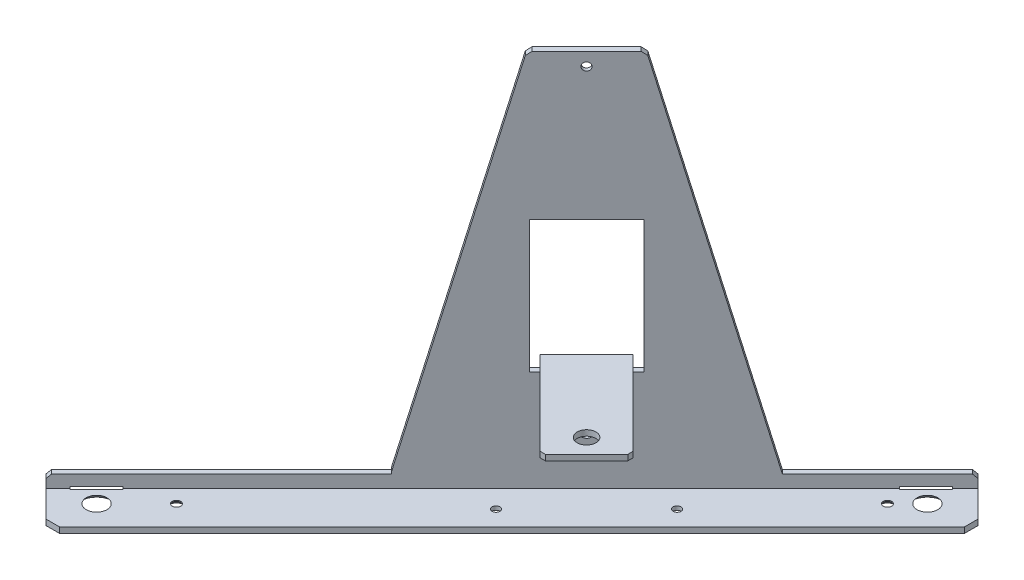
ISO-10303-21;
HEADER;
FILE_DESCRIPTION(('STEP AP214'),'2;1');
FILE_NAME('part.step','',(''),(''),'','','');
FILE_SCHEMA(('AUTOMOTIVE_DESIGN { 1 0 10303 214 1 1 1 1 }'));
ENDSEC;
DATA;
#1=APPLICATION_CONTEXT('core data for automotive mechanical design processes');
#2=APPLICATION_PROTOCOL_DEFINITION('international standard','automotive_design',2000,#1);
#3=PRODUCT_CONTEXT('',#1,'mechanical');
#4=PRODUCT('Part','Part','',(#3));
#5=PRODUCT_RELATED_PRODUCT_CATEGORY('part','',(#4));
#6=PRODUCT_DEFINITION_FORMATION('','',#4);
#7=PRODUCT_DEFINITION_CONTEXT('part definition',#1,'design');
#8=PRODUCT_DEFINITION('design','',#6,#7);
#9=PRODUCT_DEFINITION_SHAPE('','',#8);
#10=(LENGTH_UNIT() NAMED_UNIT(*) SI_UNIT(.MILLI.,.METRE.));
#11=(NAMED_UNIT(*) PLANE_ANGLE_UNIT() SI_UNIT($,.RADIAN.));
#12=(NAMED_UNIT(*) SI_UNIT($,.STERADIAN.) SOLID_ANGLE_UNIT());
#13=UNCERTAINTY_MEASURE_WITH_UNIT(LENGTH_MEASURE(1.E-05),#10,'distance_accuracy_value','');
#14=(GEOMETRIC_REPRESENTATION_CONTEXT(3) GLOBAL_UNCERTAINTY_ASSIGNED_CONTEXT((#13)) GLOBAL_UNIT_ASSIGNED_CONTEXT((#10,
#11,#12)) REPRESENTATION_CONTEXT('',''));
#15=CARTESIAN_POINT('',(0.,0.,0.));
#16=DIRECTION('',(0.,0.,1.));
#17=DIRECTION('',(1.,0.,0.));
#18=AXIS2_PLACEMENT_3D('',#15,#16,#17);
#19=CARTESIAN_POINT('',(1.49630573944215,-134.679187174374,-21.213203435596));
#20=DIRECTION('',(0.,-1.,0.));
#21=DIRECTION('',(0.,0.,-1.));
#22=AXIS2_PLACEMENT_3D('',#19,#20,#21);
#23=CYLINDRICAL_SURFACE('',#22,2.24999999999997);
#24=CARTESIAN_POINT('',(1.49630573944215,-131.679187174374,-21.213203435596));
#25=DIRECTION('',(0.,-1.,0.));
#26=DIRECTION('',(0.,0.,-1.));
#27=AXIS2_PLACEMENT_3D('',#24,#25,#26);
#28=CIRCLE('',#27,2.24999999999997);
#29=CARTESIAN_POINT('',(1.49630573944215,-131.679187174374,-23.463203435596));
#30=VERTEX_POINT('',#29);
#31=EDGE_CURVE('E387',#30,#30,#28,.F.);
#32=ORIENTED_EDGE('',*,*,#31,.T.);
#33=EDGE_LOOP('',(#32));
#34=FACE_BOUND('',#33,.T.);
#35=CARTESIAN_POINT('',(1.49630573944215,-132.229187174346,-21.213203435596));
#36=DIRECTION('',(0.,-1.,0.));
#37=DIRECTION('',(0.,0.,-1.));
#38=AXIS2_PLACEMENT_3D('',#35,#36,#37);
#39=CIRCLE('',#38,2.25000000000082);
#40=CARTESIAN_POINT('',(1.49630573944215,-132.229187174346,-23.4632034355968));
#41=VERTEX_POINT('',#40);
#42=EDGE_CURVE('E317',#41,#41,#39,.T.);
#43=ORIENTED_EDGE('',*,*,#42,.T.);
#44=EDGE_LOOP('',(#43));
#45=FACE_BOUND('',#44,.T.);
#46=ADVANCED_FACE('F17',(#34,#45),#23,.F.);
#47=CARTESIAN_POINT('',(190.29381631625,-134.679187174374,-210.010714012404));
#48=DIRECTION('',(0.,-1.,0.));
#49=DIRECTION('',(0.,0.,-1.));
#50=AXIS2_PLACEMENT_3D('',#47,#48,#49);
#51=CYLINDRICAL_SURFACE('',#50,2.24999999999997);
#52=CARTESIAN_POINT('',(190.29381631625,-131.679187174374,-210.010714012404));
#53=DIRECTION('',(0.,-1.,0.));
#54=DIRECTION('',(0.,0.,-1.));
#55=AXIS2_PLACEMENT_3D('',#52,#53,#54);
#56=CIRCLE('',#55,2.24999999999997);
#57=CARTESIAN_POINT('',(190.29381631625,-131.679187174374,-212.260714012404));
#58=VERTEX_POINT('',#57);
#59=EDGE_CURVE('E384',#58,#58,#56,.F.);
#60=ORIENTED_EDGE('',*,*,#59,.T.);
#61=EDGE_LOOP('',(#60));
#62=FACE_BOUND('',#61,.T.);
#63=CARTESIAN_POINT('',(190.29381631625,-132.229187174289,-210.010714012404));
#64=DIRECTION('',(0.,-1.,0.));
#65=DIRECTION('',(0.,0.,-1.));
#66=AXIS2_PLACEMENT_3D('',#63,#64,#65);
#67=CIRCLE('',#66,2.2500000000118);
#68=CARTESIAN_POINT('',(190.29381631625,-132.229187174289,-212.260714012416));
#69=VERTEX_POINT('',#68);
#70=EDGE_CURVE('E314',#69,#69,#67,.T.);
#71=ORIENTED_EDGE('',*,*,#70,.T.);
#72=EDGE_LOOP('',(#71));
#73=FACE_BOUND('',#72,.T.);
#74=ADVANCED_FACE('F1140',(#62,#73),#51,.F.);
#75=CARTESIAN_POINT('',(88.8239932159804,-129.579187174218,-103.591143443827));
#76=DIRECTION('',(0.,1.,0.));
#77=DIRECTION('',(0.,0.,1.));
#78=AXIS2_PLACEMENT_3D('',#75,#76,#77);
#79=CYLINDRICAL_SURFACE('',#78,2.1);
#80=CARTESIAN_POINT('',(88.8239932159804,-133.72655923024,-103.591143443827));
#81=DIRECTION('',(0.,-1.,0.));
#82=DIRECTION('',(1.,0.,0.));
#83=AXIS2_PLACEMENT_3D('',#80,#81,#82);
#84=CIRCLE('',#83,2.10000000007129);
#85=CARTESIAN_POINT('',(90.9239932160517,-133.72655923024,-103.591143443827));
#86=VERTEX_POINT('',#85);
#87=EDGE_CURVE('E311',#86,#86,#84,.T.);
#88=ORIENTED_EDGE('',*,*,#87,.T.);
#89=EDGE_LOOP('',(#88));
#90=FACE_BOUND('',#89,.T.);
#91=CARTESIAN_POINT('',(88.8239932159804,-131.679187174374,-103.591143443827));
#92=DIRECTION('',(0.,1.,0.));
#93=DIRECTION('',(0.,0.,1.));
#94=AXIS2_PLACEMENT_3D('',#91,#92,#93);
#95=CIRCLE('',#94,2.1);
#96=CARTESIAN_POINT('',(88.8239932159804,-131.679187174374,-101.491143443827));
#97=VERTEX_POINT('',#96);
#98=EDGE_CURVE('E380',#97,#97,#95,.T.);
#99=ORIENTED_EDGE('',*,*,#98,.T.);
#100=EDGE_LOOP('',(#99));
#101=FACE_BOUND('',#100,.T.);
#102=ADVANCED_FACE('F1132',(#90,#101),#79,.F.);
#103=CARTESIAN_POINT('',(136.907254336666,-129.579187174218,-151.674404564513));
#104=DIRECTION('',(0.,1.,0.));
#105=DIRECTION('',(0.,0.,1.));
#106=AXIS2_PLACEMENT_3D('',#103,#104,#105);
#107=CYLINDRICAL_SURFACE('',#106,2.09999999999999);
#108=CARTESIAN_POINT('',(136.907254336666,-133.726559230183,-151.674404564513));
#109=DIRECTION('',(0.,-1.,0.));
#110=DIRECTION('',(0.,0.,-1.));
#111=AXIS2_PLACEMENT_3D('',#108,#109,#110);
#112=CIRCLE('',#111,2.09999999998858);
#113=CARTESIAN_POINT('',(136.907254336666,-133.726559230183,-153.774404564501));
#114=VERTEX_POINT('',#113);
#115=EDGE_CURVE('E307',#114,#114,#112,.T.);
#116=ORIENTED_EDGE('',*,*,#115,.T.);
#117=EDGE_LOOP('',(#116));
#118=FACE_BOUND('',#117,.T.);
#119=CARTESIAN_POINT('',(136.907254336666,-131.679187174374,-151.674404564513));
#120=DIRECTION('',(0.,1.,0.));
#121=DIRECTION('',(0.,0.,1.));
#122=AXIS2_PLACEMENT_3D('',#119,#120,#121);
#123=CIRCLE('',#122,2.09999999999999);
#124=CARTESIAN_POINT('',(136.907254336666,-131.679187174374,-149.574404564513));
#125=VERTEX_POINT('',#124);
#126=EDGE_CURVE('E377',#125,#125,#123,.T.);
#127=ORIENTED_EDGE('',*,*,#126,.T.);
#128=EDGE_LOOP('',(#127));
#129=FACE_BOUND('',#128,.T.);
#130=ADVANCED_FACE('F1124',(#118,#129),#107,.F.);
#131=CARTESIAN_POINT('',(139.382128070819,-72.1791871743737,-101.116269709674));
#132=DIRECTION('',(0.,1.,0.));
#133=DIRECTION('',(-1.,0.,0.));
#134=AXIS2_PLACEMENT_3D('',#131,#132,#133);
#135=CYLINDRICAL_SURFACE('',#134,4.99999999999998);
#136=CARTESIAN_POINT('',(139.382128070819,-75.1791871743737,-101.116269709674));
#137=DIRECTION('',(0.,1.,0.));
#138=DIRECTION('',(-1.,0.,0.));
#139=AXIS2_PLACEMENT_3D('',#136,#137,#138);
#140=CIRCLE('',#139,4.99999999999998);
#141=CARTESIAN_POINT('',(134.382128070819,-75.1791871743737,-101.116269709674));
#142=VERTEX_POINT('',#141);
#143=EDGE_CURVE('E20',#142,#142,#140,.F.);
#144=ORIENTED_EDGE('',*,*,#143,.T.);
#145=EDGE_LOOP('',(#144));
#146=FACE_BOUND('',#145,.T.);
#147=CARTESIAN_POINT('',(139.382128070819,-72.1791871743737,-101.116269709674));
#148=DIRECTION('',(0.,1.,0.));
#149=DIRECTION('',(-1.,0.,0.));
#150=AXIS2_PLACEMENT_3D('',#147,#148,#149);
#151=CIRCLE('',#150,4.99999999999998);
#152=CARTESIAN_POINT('',(134.382128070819,-72.1791871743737,-101.116269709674));
#153=VERTEX_POINT('',#152);
#154=EDGE_CURVE('E354',#153,#153,#151,.F.);
#155=ORIENTED_EDGE('',*,*,#154,.F.);
#156=EDGE_LOOP('',(#155));
#157=FACE_BOUND('',#156,.T.);
#158=ADVANCED_FACE('F1117',(#146,#157),#135,.F.);
#159=CARTESIAN_POINT('',(171.909040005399,-72.1791871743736,-82.377940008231));
#160=DIRECTION('',(0.,0.,-1.));
#161=DIRECTION('',(0.,1.,0.));
#162=AXIS2_PLACEMENT_3D('',#159,#160,#161);
#163=PLANE('',#162);
#164=DIRECTION('',(0.,1.,0.));
#165=VECTOR('',#164,1.);
#166=CARTESIAN_POINT('',(133.371720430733,-78.1791871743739,-82.377940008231));
#167=LINE('',#166,#165);
#168=CARTESIAN_POINT('',(133.371720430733,-72.1791871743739,-82.3779400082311));
#169=VERTEX_POINT('',#168);
#170=CARTESIAN_POINT('',(133.371720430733,-75.1791871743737,-82.3779400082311));
#171=VERTEX_POINT('',#170);
#172=EDGE_CURVE('E293',#169,#171,#167,.F.);
#173=ORIENTED_EDGE('',*,*,#172,.T.);
#174=DIRECTION('',(-1.,0.,0.));
#175=VECTOR('',#174,1.);
#176=CARTESIAN_POINT('',(171.909040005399,-75.1791871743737,-82.3779400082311));
#177=LINE('',#176,#175);
#178=CARTESIAN_POINT('',(136.200147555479,-75.1791871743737,-82.3779400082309));
#179=VERTEX_POINT('',#178);
#180=EDGE_CURVE('E291',#171,#179,#177,.F.);
#181=ORIENTED_EDGE('',*,*,#180,.T.);
#182=DIRECTION('',(0.,1.,0.));
#183=VECTOR('',#182,1.);
#184=CARTESIAN_POINT('',(136.200147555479,-72.1791871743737,-82.3779400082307));
#185=LINE('',#184,#183);
#186=CARTESIAN_POINT('',(136.200147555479,-72.1791871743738,-82.377940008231));
#187=VERTEX_POINT('',#186);
#188=EDGE_CURVE('E281',#179,#187,#185,.T.);
#189=ORIENTED_EDGE('',*,*,#188,.T.);
#190=DIRECTION('',(-1.,0.,0.));
#191=VECTOR('',#190,1.);
#192=CARTESIAN_POINT('',(171.909040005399,-72.1791871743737,-82.3779400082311));
#193=LINE('',#192,#191);
#194=EDGE_CURVE('E413',#169,#187,#193,.F.);
#195=ORIENTED_EDGE('',*,*,#194,.F.);
#196=EDGE_LOOP('',(#173,#181,#189,#195));
#197=FACE_BOUND('',#196,.T.);
#198=ADVANCED_FACE('F292',(#197),#163,.F.);
#199=CARTESIAN_POINT('',(134.07882721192,-72.1791871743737,-80.2566196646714));
#200=DIRECTION('',(-0.707106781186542,0.,-0.707106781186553));
#201=DIRECTION('',(-0.707106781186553,0.,0.707106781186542));
#202=AXIS2_PLACEMENT_3D('',#199,#200,#201);
#203=PLANE('',#202);
#204=ORIENTED_EDGE('',*,*,#188,.F.);
#205=DIRECTION('',(0.707106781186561,0.,-0.707106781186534));
#206=VECTOR('',#205,1.);
#207=CARTESIAN_POINT('',(136.200147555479,-75.1791871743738,-82.377940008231));
#208=LINE('',#207,#206);
#209=CARTESIAN_POINT('',(158.120457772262,-75.1791871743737,-104.298250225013));
#210=VERTEX_POINT('',#209);
#211=EDGE_CURVE('E278',#179,#210,#208,.T.);
#212=ORIENTED_EDGE('',*,*,#211,.T.);
#213=DIRECTION('',(0.,1.,0.));
#214=VECTOR('',#213,1.);
#215=CARTESIAN_POINT('',(158.120457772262,-72.1791871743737,-104.298250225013));
#216=LINE('',#215,#214);
#217=CARTESIAN_POINT('',(158.120457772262,-72.1791871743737,-104.298250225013));
#218=VERTEX_POINT('',#217);
#219=EDGE_CURVE('E296',#218,#210,#216,.F.);
#220=ORIENTED_EDGE('',*,*,#219,.F.);
#221=DIRECTION('',(0.707106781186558,0.,-0.707106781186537));
#222=VECTOR('',#221,1.);
#223=CARTESIAN_POINT('',(136.200147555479,-72.1791871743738,-82.3779400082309));
#224=LINE('',#223,#222);
#225=EDGE_CURVE('E285',#187,#218,#224,.T.);
#226=ORIENTED_EDGE('',*,*,#225,.F.);
#227=EDGE_LOOP('',(#204,#212,#220,#226));
#228=FACE_BOUND('',#227,.T.);
#229=ADVANCED_FACE('F283',(#228),#203,.F.);
#230=CARTESIAN_POINT('',(171.909040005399,-75.1791871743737,-96.8736290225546));
#231=DIRECTION('',(0.,1.,0.));
#232=DIRECTION('',(-1.,0.,0.));
#233=AXIS2_PLACEMENT_3D('',#230,#231,#232);
#234=PLANE('',#233);
#235=DIRECTION('',(-0.707106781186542,0.,-0.707106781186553));
#236=VECTOR('',#235,1.);
#237=CARTESIAN_POINT('',(88.8239932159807,-75.1791871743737,-126.925667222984));
#238=LINE('',#237,#236);
#239=CARTESIAN_POINT('',(90.9453135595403,-75.1791871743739,-124.804346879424));
#240=VERTEX_POINT('',#239);
#241=EDGE_CURVE('E422',#171,#240,#238,.T.);
#242=ORIENTED_EDGE('',*,*,#241,.T.);
#243=DIRECTION('',(-0.707106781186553,0.,0.707106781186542));
#244=VECTOR('',#243,1.);
#245=CARTESIAN_POINT('',(156.352690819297,-75.1791871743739,-190.21172413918));
#246=LINE('',#245,#244);
#247=CARTESIAN_POINT('',(115.694050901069,-75.1791871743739,-149.553084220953));
#248=VERTEX_POINT('',#247);
#249=EDGE_CURVE('E369',#240,#248,#246,.F.);
#250=ORIENTED_EDGE('',*,*,#249,.T.);
#251=DIRECTION('',(0.707106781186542,0.,0.707106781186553));
#252=VECTOR('',#251,1.);
#253=CARTESIAN_POINT('',(159.534671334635,-75.1791871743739,-105.712463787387));
#254=LINE('',#253,#252);
#255=CARTESIAN_POINT('',(158.120457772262,-75.1791871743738,-107.12667734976));
#256=VERTEX_POINT('',#255);
#257=EDGE_CURVE('E536',#248,#256,#254,.T.);
#258=ORIENTED_EDGE('',*,*,#257,.T.);
#259=DIRECTION('',(0.,0.,-1.));
#260=VECTOR('',#259,1.);
#261=CARTESIAN_POINT('',(158.120457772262,-75.1791871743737,-96.8736290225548));
#262=LINE('',#261,#260);
#263=EDGE_CURVE('E301',#210,#256,#262,.T.);
#264=ORIENTED_EDGE('',*,*,#263,.F.);
#265=ORIENTED_EDGE('',*,*,#211,.F.);
#266=ORIENTED_EDGE('',*,*,#180,.F.);
#267=EDGE_LOOP('',(#242,#250,#258,#264,#265,#266));
#268=FACE_BOUND('',#267,.T.);
#269=ORIENTED_EDGE('',*,*,#143,.F.);
#270=EDGE_LOOP('',(#269));
#271=FACE_BOUND('',#270,.T.);
#272=ADVANCED_FACE('F298',(#268,#271),#234,.F.);
#273=CARTESIAN_POINT('',(158.120457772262,-72.1791871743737,-96.8736290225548));
#274=DIRECTION('',(1.,0.,0.));
#275=DIRECTION('',(0.,0.,-1.));
#276=AXIS2_PLACEMENT_3D('',#273,#274,#275);
#277=PLANE('',#276);
#278=DIRECTION('',(0.,1.,0.));
#279=VECTOR('',#278,1.);
#280=CARTESIAN_POINT('',(158.120457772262,-72.1791871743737,-107.12667734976));
#281=LINE('',#280,#279);
#282=CARTESIAN_POINT('',(158.120457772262,-72.1791871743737,-107.12667734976));
#283=VERTEX_POINT('',#282);
#284=EDGE_CURVE('E405',#256,#283,#281,.T.);
#285=ORIENTED_EDGE('',*,*,#284,.T.);
#286=DIRECTION('',(0.,0.,1.));
#287=VECTOR('',#286,1.);
#288=CARTESIAN_POINT('',(158.120457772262,-72.1791871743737,-96.8736290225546));
#289=LINE('',#288,#287);
#290=EDGE_CURVE('E404',#218,#283,#289,.F.);
#291=ORIENTED_EDGE('',*,*,#290,.F.);
#292=ORIENTED_EDGE('',*,*,#219,.T.);
#293=ORIENTED_EDGE('',*,*,#263,.T.);
#294=EDGE_LOOP('',(#285,#291,#292,#293));
#295=FACE_BOUND('',#294,.T.);
#296=ADVANCED_FACE('F402',(#295),#277,.T.);
#297=CARTESIAN_POINT('',(1.49630573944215,-134.679187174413,-21.213203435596));
#298=DIRECTION('',(0.,-1.,0.));
#299=DIRECTION('',(0.,0.,-1.));
#300=AXIS2_PLACEMENT_3D('',#297,#298,#299);
#301=CONICAL_SURFACE('',#300,4.70000000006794,0.785398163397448);
#302=CARTESIAN_POINT('',(1.49630573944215,-134.679187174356,-21.213203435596));
#303=DIRECTION('',(0.,-1.,0.));
#304=DIRECTION('',(0.,0.,-1.));
#305=AXIS2_PLACEMENT_3D('',#302,#303,#304);
#306=CIRCLE('',#305,4.7000000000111);
#307=CARTESIAN_POINT('',(1.49630573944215,-134.679187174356,-25.9132034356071));
#308=VERTEX_POINT('',#307);
#309=EDGE_CURVE('E350',#308,#308,#306,.F.);
#310=ORIENTED_EDGE('',*,*,#309,.F.);
#311=EDGE_LOOP('',(#310));
#312=FACE_BOUND('',#311,.T.);
#313=ORIENTED_EDGE('',*,*,#42,.F.);
#314=EDGE_LOOP('',(#313));
#315=FACE_BOUND('',#314,.T.);
#316=ADVANCED_FACE('F1084',(#312,#315),#301,.F.);
#317=CARTESIAN_POINT('',(190.29381631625,-134.679187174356,-210.010714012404));
#318=DIRECTION('',(0.,-1.,0.));
#319=DIRECTION('',(0.,0.,-1.));
#320=AXIS2_PLACEMENT_3D('',#317,#318,#319);
#321=CONICAL_SURFACE('',#320,4.70000000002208,0.785398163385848);
#322=CARTESIAN_POINT('',(190.29381631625,-134.679187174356,-210.010714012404));
#323=DIRECTION('',(0.,-1.,0.));
#324=DIRECTION('',(0.,0.,-1.));
#325=AXIS2_PLACEMENT_3D('',#322,#323,#324);
#326=CIRCLE('',#325,4.70000000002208);
#327=CARTESIAN_POINT('',(190.29381631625,-134.679187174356,-214.710714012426));
#328=VERTEX_POINT('',#327);
#329=EDGE_CURVE('E347',#328,#328,#326,.F.);
#330=ORIENTED_EDGE('',*,*,#329,.F.);
#331=EDGE_LOOP('',(#330));
#332=FACE_BOUND('',#331,.T.);
#333=ORIENTED_EDGE('',*,*,#70,.F.);
#334=EDGE_LOOP('',(#333));
#335=FACE_BOUND('',#334,.T.);
#336=ADVANCED_FACE('F1076',(#332,#335),#321,.F.);
#337=CARTESIAN_POINT('',(88.8239932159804,-134.679187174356,-103.591143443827));
#338=DIRECTION('',(0.,-1.,0.));
#339=DIRECTION('',(1.,0.,0.));
#340=AXIS2_PLACEMENT_3D('',#337,#338,#339);
#341=CONICAL_SURFACE('',#340,3.74999999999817,1.04719755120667);
#342=ORIENTED_EDGE('',*,*,#87,.F.);
#343=EDGE_LOOP('',(#342));
#344=FACE_BOUND('',#343,.T.);
#345=CARTESIAN_POINT('',(88.8239932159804,-134.679187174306,-103.591143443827));
#346=DIRECTION('',(0.,-1.,0.));
#347=DIRECTION('',(1.,0.,0.));
#348=AXIS2_PLACEMENT_3D('',#345,#346,#347);
#349=CIRCLE('',#348,3.74999999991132);
#350=CARTESIAN_POINT('',(92.5739932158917,-134.679187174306,-103.591143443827));
#351=VERTEX_POINT('',#350);
#352=EDGE_CURVE('E344',#351,#351,#349,.F.);
#353=ORIENTED_EDGE('',*,*,#352,.F.);
#354=EDGE_LOOP('',(#353));
#355=FACE_BOUND('',#354,.T.);
#356=ADVANCED_FACE('F1068',(#344,#355),#341,.F.);
#357=CARTESIAN_POINT('',(136.907254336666,-134.679187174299,-151.674404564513));
#358=DIRECTION('',(0.,-1.,0.));
#359=DIRECTION('',(0.,0.,-1.));
#360=AXIS2_PLACEMENT_3D('',#357,#358,#359);
#361=CONICAL_SURFACE('',#360,3.74999999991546,1.04719755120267);
#362=ORIENTED_EDGE('',*,*,#115,.F.);
#363=EDGE_LOOP('',(#362));
#364=FACE_BOUND('',#363,.T.);
#365=CARTESIAN_POINT('',(136.907254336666,-134.67918717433,-151.674404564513));
#366=DIRECTION('',(0.,-1.,0.));
#367=DIRECTION('',(0.,0.,-1.));
#368=AXIS2_PLACEMENT_3D('',#365,#366,#367);
#369=CIRCLE('',#368,3.74999999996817);
#370=CARTESIAN_POINT('',(136.907254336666,-134.67918717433,-155.424404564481));
#371=VERTEX_POINT('',#370);
#372=EDGE_CURVE('E341',#371,#371,#369,.F.);
#373=ORIENTED_EDGE('',*,*,#372,.F.);
#374=EDGE_LOOP('',(#373));
#375=FACE_BOUND('',#374,.T.);
#376=ADVANCED_FACE('F1060',(#364,#375),#361,.F.);
#377=CARTESIAN_POINT('',(200.90041803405,-134.679187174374,-220.617315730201));
#378=DIRECTION('',(0.,-1.,0.));
#379=DIRECTION('',(0.,0.,-1.));
#380=AXIS2_PLACEMENT_3D('',#377,#378,#379);
#381=CONICAL_SURFACE('',#380,8.50000000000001,0.785398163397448);
#382=CARTESIAN_POINT('',(200.90041803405,-131.679187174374,-220.617315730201));
#383=DIRECTION('',(0.,-1.,0.));
#384=DIRECTION('',(0.,0.,-1.));
#385=AXIS2_PLACEMENT_3D('',#382,#383,#384);
#386=CIRCLE('',#385,5.49999999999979);
#387=CARTESIAN_POINT('',(200.90041803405,-131.679187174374,-226.117315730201));
#388=VERTEX_POINT('',#387);
#389=EDGE_CURVE('E374',#388,#388,#386,.F.);
#390=ORIENTED_EDGE('',*,*,#389,.T.);
#391=EDGE_LOOP('',(#390));
#392=FACE_BOUND('',#391,.T.);
#393=CARTESIAN_POINT('',(200.90041803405,-134.679187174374,-220.617315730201));
#394=DIRECTION('',(0.,-1.,0.));
#395=DIRECTION('',(0.,0.,-1.));
#396=AXIS2_PLACEMENT_3D('',#393,#394,#395);
#397=CIRCLE('',#396,8.49999999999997);
#398=CARTESIAN_POINT('',(200.90041803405,-134.679187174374,-229.117315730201));
#399=VERTEX_POINT('',#398);
#400=EDGE_CURVE('E338',#399,#399,#397,.F.);
#401=ORIENTED_EDGE('',*,*,#400,.F.);
#402=EDGE_LOOP('',(#401));
#403=FACE_BOUND('',#402,.T.);
#404=ADVANCED_FACE('F1052',(#392,#403),#381,.F.);
#405=CARTESIAN_POINT('',(-19.7168976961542,-134.679187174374,0.));
#406=DIRECTION('',(0.,-1.,0.));
#407=DIRECTION('',(0.,0.,-1.));
#408=AXIS2_PLACEMENT_3D('',#405,#406,#407);
#409=CONICAL_SURFACE('',#408,8.49999999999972,0.785398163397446);
#410=CARTESIAN_POINT('',(-19.7168976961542,-131.679187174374,0.));
#411=DIRECTION('',(0.,-1.,0.));
#412=DIRECTION('',(0.,0.,-1.));
#413=AXIS2_PLACEMENT_3D('',#410,#411,#412);
#414=CIRCLE('',#413,5.49999999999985);
#415=CARTESIAN_POINT('',(-19.7168976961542,-131.679187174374,-5.49999999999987));
#416=VERTEX_POINT('',#415);
#417=EDGE_CURVE('E370',#416,#416,#414,.F.);
#418=ORIENTED_EDGE('',*,*,#417,.T.);
#419=EDGE_LOOP('',(#418));
#420=FACE_BOUND('',#419,.T.);
#421=CARTESIAN_POINT('',(-19.7168976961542,-134.679187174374,0.));
#422=DIRECTION('',(0.,-1.,0.));
#423=DIRECTION('',(0.,0.,-1.));
#424=AXIS2_PLACEMENT_3D('',#421,#422,#423);
#425=CIRCLE('',#424,8.49999999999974);
#426=CARTESIAN_POINT('',(-19.7168976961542,-134.679187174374,-8.49999999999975));
#427=VERTEX_POINT('',#426);
#428=EDGE_CURVE('E334',#427,#427,#425,.F.);
#429=ORIENTED_EDGE('',*,*,#428,.F.);
#430=EDGE_LOOP('',(#429));
#431=FACE_BOUND('',#430,.T.);
#432=ADVANCED_FACE('F1045',(#420,#431),#409,.F.);
#433=CARTESIAN_POINT('',(201.183260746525,-136.779187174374,-233.769501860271));
#434=DIRECTION('',(-0.707106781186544,0.,-0.707106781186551));
#435=DIRECTION('',(-0.707106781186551,0.,0.707106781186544));
#436=AXIS2_PLACEMENT_3D('',#433,#434,#435);
#437=PLANE('',#436);
#438=DIRECTION('',(0.,1.,0.));
#439=VECTOR('',#438,1.);
#440=CARTESIAN_POINT('',(201.183260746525,-136.779187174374,-233.769501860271));
#441=LINE('',#440,#439);
#442=CARTESIAN_POINT('',(201.183260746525,-131.679187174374,-233.769501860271));
#443=VERTEX_POINT('',#442);
#444=CARTESIAN_POINT('',(201.183260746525,-134.679187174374,-233.769501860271));
#445=VERTEX_POINT('',#444);
#446=EDGE_CURVE('E465',#443,#445,#441,.F.);
#447=ORIENTED_EDGE('',*,*,#446,.T.);
#448=DIRECTION('',(0.707106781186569,0.,-0.707106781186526));
#449=VECTOR('',#448,1.);
#450=CARTESIAN_POINT('',(187.041125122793,-134.679187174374,-219.62736623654));
#451=LINE('',#450,#449);
#452=CARTESIAN_POINT('',(187.041125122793,-134.679187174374,-219.62736623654));
#453=VERTEX_POINT('',#452);
#454=EDGE_CURVE('E626',#453,#445,#451,.T.);
#455=ORIENTED_EDGE('',*,*,#454,.F.);
#456=DIRECTION('',(0.,1.,0.));
#457=VECTOR('',#456,1.);
#458=CARTESIAN_POINT('',(187.041125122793,-130.779187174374,-219.62736623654));
#459=LINE('',#458,#457);
#460=CARTESIAN_POINT('',(187.041125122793,-131.679187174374,-219.62736623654));
#461=VERTEX_POINT('',#460);
#462=EDGE_CURVE('E467',#453,#461,#459,.T.);
#463=ORIENTED_EDGE('',*,*,#462,.T.);
#464=DIRECTION('',(0.707106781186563,0.,-0.707106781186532));
#465=VECTOR('',#464,1.);
#466=CARTESIAN_POINT('',(187.041125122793,-131.679187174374,-219.62736623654));
#467=LINE('',#466,#465);
#468=EDGE_CURVE('E386',#461,#443,#467,.T.);
#469=ORIENTED_EDGE('',*,*,#468,.T.);
#470=EDGE_LOOP('',(#447,#455,#463,#469));
#471=FACE_BOUND('',#470,.T.);
#472=ADVANCED_FACE('F462',(#471),#437,.T.);
#473=CARTESIAN_POINT('',(221.406514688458,-134.679187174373,2.82842712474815));
#474=DIRECTION('',(-1.,0.,0.));
#475=DIRECTION('',(0.,0.,1.));
#476=AXIS2_PLACEMENT_3D('',#473,#474,#475);
#477=PLANE('',#476);
#478=DIRECTION('',(0.,1.,0.));
#479=VECTOR('',#478,1.);
#480=CARTESIAN_POINT('',(221.40651468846,-134.679187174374,-226.98127676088));
#481=LINE('',#480,#479);
#482=CARTESIAN_POINT('',(221.40651468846,-131.679187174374,-226.98127676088));
#483=VERTEX_POINT('',#482);
#484=CARTESIAN_POINT('',(221.40651468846,-134.679187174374,-226.98127676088));
#485=VERTEX_POINT('',#484);
#486=EDGE_CURVE('E500',#483,#485,#481,.F.);
#487=ORIENTED_EDGE('',*,*,#486,.F.);
#488=DIRECTION('',(0.,0.,-1.));
#489=VECTOR('',#488,1.);
#490=CARTESIAN_POINT('',(221.40651468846,-131.679187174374,2.82842712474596));
#491=LINE('',#490,#489);
#492=CARTESIAN_POINT('',(221.40651468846,-131.679187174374,-219.910208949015));
#493=VERTEX_POINT('',#492);
#494=EDGE_CURVE('E456',#483,#493,#491,.F.);
#495=ORIENTED_EDGE('',*,*,#494,.T.);
#496=DIRECTION('',(0.,1.,0.));
#497=VECTOR('',#496,1.);
#498=CARTESIAN_POINT('',(221.40651468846,-134.679187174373,-219.910208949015));
#499=LINE('',#498,#497);
#500=CARTESIAN_POINT('',(221.40651468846,-134.679187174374,-219.910208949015));
#501=VERTEX_POINT('',#500);
#502=EDGE_CURVE('E310',#501,#493,#499,.T.);
#503=ORIENTED_EDGE('',*,*,#502,.F.);
#504=DIRECTION('',(0.,0.,-1.));
#505=VECTOR('',#504,1.);
#506=CARTESIAN_POINT('',(221.40651468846,-134.679187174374,2.82842712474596));
#507=LINE('',#506,#505);
#508=EDGE_CURVE('E619',#485,#501,#507,.F.);
#509=ORIENTED_EDGE('',*,*,#508,.F.);
#510=EDGE_LOOP('',(#487,#495,#503,#509));
#511=FACE_BOUND('',#510,.T.);
#512=ADVANCED_FACE('F1032',(#511),#477,.F.);
#513=CARTESIAN_POINT('',(-22.5453248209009,-134.679187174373,24.041630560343));
#514=DIRECTION('',(0.707106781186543,0.,0.707106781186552));
#515=DIRECTION('',(0.707106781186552,0.,-0.707106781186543));
#516=AXIS2_PLACEMENT_3D('',#513,#514,#515);
#517=PLANE('',#516);
#518=DIRECTION('',(0.,1.,0.));
#519=VECTOR('',#518,1.);
#520=CARTESIAN_POINT('',(-19.0097909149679,-134.679187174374,20.50609665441));
#521=LINE('',#520,#519);
#522=CARTESIAN_POINT('',(-19.0097909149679,-131.679187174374,20.50609665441));
#523=VERTEX_POINT('',#522);
#524=CARTESIAN_POINT('',(-19.0097909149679,-134.679187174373,20.50609665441));
#525=VERTEX_POINT('',#524);
#526=EDGE_CURVE('E450',#523,#525,#521,.F.);
#527=ORIENTED_EDGE('',*,*,#526,.T.);
#528=DIRECTION('',(-0.707106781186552,0.,0.707106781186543));
#529=VECTOR('',#528,1.);
#530=CARTESIAN_POINT('',(221.40651468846,-134.679187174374,-219.910208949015));
#531=LINE('',#530,#529);
#532=EDGE_CURVE('E616',#501,#525,#531,.T.);
#533=ORIENTED_EDGE('',*,*,#532,.F.);
#534=ORIENTED_EDGE('',*,*,#502,.T.);
#535=DIRECTION('',(-0.707106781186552,0.,0.707106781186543));
#536=VECTOR('',#535,1.);
#537=CARTESIAN_POINT('',(221.40651468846,-131.679187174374,-219.910208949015));
#538=LINE('',#537,#536);
#539=EDGE_CURVE('E455',#493,#523,#538,.T.);
#540=ORIENTED_EDGE('',*,*,#539,.T.);
#541=EDGE_LOOP('',(#527,#533,#534,#540));
#542=FACE_BOUND('',#541,.T.);
#543=ADVANCED_FACE('F1024',(#542),#517,.T.);
#544=CARTESIAN_POINT('',(-33.2226372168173,-136.779187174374,0.636396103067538));
#545=DIRECTION('',(0.707106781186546,0.,0.707106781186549));
#546=DIRECTION('',(0.707106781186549,0.,-0.707106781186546));
#547=AXIS2_PLACEMENT_3D('',#544,#545,#546);
#548=PLANE('',#547);
#549=DIRECTION('',(0.707106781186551,0.,-0.707106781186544));
#550=VECTOR('',#549,1.);
#551=CARTESIAN_POINT('',(-33.2226372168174,-131.679187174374,0.63639610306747));
#552=LINE('',#551,#550);
#553=CARTESIAN_POINT('',(-33.2226372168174,-131.679187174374,0.63639610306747));
#554=VERTEX_POINT('',#553);
#555=CARTESIAN_POINT('',(-19.0805015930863,-131.679187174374,-13.5057395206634));
#556=VERTEX_POINT('',#555);
#557=EDGE_CURVE('E383',#554,#556,#552,.T.);
#558=ORIENTED_EDGE('',*,*,#557,.T.);
#559=DIRECTION('',(0.,1.,0.));
#560=VECTOR('',#559,1.);
#561=CARTESIAN_POINT('',(-19.0805015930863,-130.779187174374,-13.5057395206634));
#562=LINE('',#561,#560);
#563=CARTESIAN_POINT('',(-19.0805015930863,-134.679187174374,-13.5057395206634));
#564=VERTEX_POINT('',#563);
#565=EDGE_CURVE('E649',#564,#556,#562,.T.);
#566=ORIENTED_EDGE('',*,*,#565,.F.);
#567=DIRECTION('',(0.707106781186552,0.,-0.707106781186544));
#568=VECTOR('',#567,1.);
#569=CARTESIAN_POINT('',(-33.2226372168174,-134.679187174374,0.636396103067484));
#570=LINE('',#569,#568);
#571=CARTESIAN_POINT('',(-33.2226372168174,-134.679187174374,0.63639610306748));
#572=VERTEX_POINT('',#571);
#573=EDGE_CURVE('E607',#572,#564,#570,.T.);
#574=ORIENTED_EDGE('',*,*,#573,.F.);
#575=DIRECTION('',(0.,1.,0.));
#576=VECTOR('',#575,1.);
#577=CARTESIAN_POINT('',(-33.2226372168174,-136.779187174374,0.636396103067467));
#578=LINE('',#577,#576);
#579=EDGE_CURVE('E632',#554,#572,#578,.F.);
#580=ORIENTED_EDGE('',*,*,#579,.F.);
#581=EDGE_LOOP('',(#558,#566,#574,#580));
#582=FACE_BOUND('',#581,.T.);
#583=ADVANCED_FACE('F1016',(#582),#548,.F.);
#584=CARTESIAN_POINT('',(-43.7585282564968,-131.679187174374,2.82842712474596));
#585=DIRECTION('',(0.,-1.,0.));
#586=DIRECTION('',(0.,0.,-1.));
#587=AXIS2_PLACEMENT_3D('',#584,#585,#586);
#588=PLANE('',#587);
#589=ORIENTED_EDGE('',*,*,#417,.F.);
#590=EDGE_LOOP('',(#589));
#591=FACE_BOUND('',#590,.T.);
#592=ORIENTED_EDGE('',*,*,#389,.F.);
#593=EDGE_LOOP('',(#592));
#594=FACE_BOUND('',#593,.T.);
#595=ORIENTED_EDGE('',*,*,#126,.F.);
#596=EDGE_LOOP('',(#595));
#597=FACE_BOUND('',#596,.T.);
#598=ORIENTED_EDGE('',*,*,#98,.F.);
#599=EDGE_LOOP('',(#598));
#600=FACE_BOUND('',#599,.T.);
#601=DIRECTION('',(0.707106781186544,0.,0.707106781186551));
#602=VECTOR('',#601,1.);
#603=CARTESIAN_POINT('',(-19.0805015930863,-131.679187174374,-13.5057395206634));
#604=LINE('',#603,#602);
#605=CARTESIAN_POINT('',(-19.7168976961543,-131.679187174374,-14.1421356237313));
#606=VERTEX_POINT('',#605);
#607=EDGE_CURVE('E646',#556,#606,#604,.F.);
#608=ORIENTED_EDGE('',*,*,#607,.F.);
#609=ORIENTED_EDGE('',*,*,#557,.F.);
#610=DIRECTION('',(-0.707106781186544,0.,-0.707106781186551));
#611=VECTOR('',#610,1.);
#612=CARTESIAN_POINT('',(-33.2226372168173,-131.679187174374,0.636396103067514));
#613=LINE('',#612,#611);
#614=CARTESIAN_POINT('',(-33.8590333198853,-131.679187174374,-5.24022244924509E-13));
#615=VERTEX_POINT('',#614);
#616=EDGE_CURVE('E634',#615,#554,#613,.F.);
#617=ORIENTED_EDGE('',*,*,#616,.F.);
#618=DIRECTION('',(-0.707106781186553,0.,0.707106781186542));
#619=VECTOR('',#618,1.);
#620=CARTESIAN_POINT('',(156.352690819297,-131.679187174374,-190.21172413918));
#621=LINE('',#620,#619);
#622=CARTESIAN_POINT('',(-40.2229943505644,-131.679187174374,6.36396103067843));
#623=VERTEX_POINT('',#622);
#624=EDGE_CURVE('E437',#615,#623,#621,.T.);
#625=ORIENTED_EDGE('',*,*,#624,.T.);
#626=DIRECTION('',(-0.707106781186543,0.,-0.707106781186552));
#627=VECTOR('',#626,1.);
#628=CARTESIAN_POINT('',(-43.7585282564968,-131.679187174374,2.82842712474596));
#629=LINE('',#628,#627);
#630=CARTESIAN_POINT('',(-26.0808587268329,-131.679187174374,20.50609665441));
#631=VERTEX_POINT('',#630);
#632=EDGE_CURVE('E600',#623,#631,#629,.F.);
#633=ORIENTED_EDGE('',*,*,#632,.T.);
#634=DIRECTION('',(1.,0.,0.));
#635=VECTOR('',#634,1.);
#636=CARTESIAN_POINT('',(-43.7585282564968,-131.679187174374,20.50609665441));
#637=LINE('',#636,#635);
#638=EDGE_CURVE('E373',#631,#523,#637,.T.);
#639=ORIENTED_EDGE('',*,*,#638,.T.);
#640=ORIENTED_EDGE('',*,*,#539,.F.);
#641=ORIENTED_EDGE('',*,*,#494,.F.);
#642=DIRECTION('',(-0.707106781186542,0.,-0.707106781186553));
#643=VECTOR('',#642,1.);
#644=CARTESIAN_POINT('',(205.143058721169,-131.679187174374,-243.244732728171));
#645=LINE('',#644,#643);
#646=CARTESIAN_POINT('',(207.264379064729,-131.679187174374,-241.123412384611));
#647=VERTEX_POINT('',#646);
#648=EDGE_CURVE('E491',#647,#483,#645,.F.);
#649=ORIENTED_EDGE('',*,*,#648,.F.);
#650=DIRECTION('',(-0.707106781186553,0.,0.707106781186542));
#651=VECTOR('',#650,1.);
#652=CARTESIAN_POINT('',(156.352690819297,-131.679187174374,-190.21172413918));
#653=LINE('',#652,#651);
#654=CARTESIAN_POINT('',(200.546864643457,-131.679187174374,-234.405897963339));
#655=VERTEX_POINT('',#654);
#656=EDGE_CURVE('E441',#647,#655,#653,.T.);
#657=ORIENTED_EDGE('',*,*,#656,.T.);
#658=DIRECTION('',(-0.707106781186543,0.,-0.707106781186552));
#659=VECTOR('',#658,1.);
#660=CARTESIAN_POINT('',(201.183260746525,-131.679187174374,-233.769501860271));
#661=LINE('',#660,#659);
#662=EDGE_CURVE('E471',#655,#443,#661,.F.);
#663=ORIENTED_EDGE('',*,*,#662,.T.);
#664=ORIENTED_EDGE('',*,*,#468,.F.);
#665=DIRECTION('',(0.707106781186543,0.,0.707106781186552));
#666=VECTOR('',#665,1.);
#667=CARTESIAN_POINT('',(187.041125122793,-131.679187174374,-219.62736623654));
#668=LINE('',#667,#666);
#669=CARTESIAN_POINT('',(186.404729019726,-131.679187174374,-220.263762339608));
#670=VERTEX_POINT('',#669);
#671=EDGE_CURVE('E658',#461,#670,#668,.F.);
#672=ORIENTED_EDGE('',*,*,#671,.T.);
#673=DIRECTION('',(-0.707106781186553,0.,0.707106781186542));
#674=VECTOR('',#673,1.);
#675=CARTESIAN_POINT('',(156.352690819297,-131.679187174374,-190.21172413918));
#676=LINE('',#675,#674);
#677=EDGE_CURVE('E439',#670,#606,#676,.T.);
#678=ORIENTED_EDGE('',*,*,#677,.T.);
#679=EDGE_LOOP('',(#608,#609,#617,#625,#633,#639,#640,#641,#649,#657,#663,#664,#672,#678));
#680=FACE_BOUND('',#679,.T.);
#681=ORIENTED_EDGE('',*,*,#59,.F.);
#682=EDGE_LOOP('',(#681));
#683=FACE_BOUND('',#682,.T.);
#684=ORIENTED_EDGE('',*,*,#31,.F.);
#685=EDGE_LOOP('',(#684));
#686=FACE_BOUND('',#685,.T.);
#687=ADVANCED_FACE('F473',(#591,#594,#597,#600,#680,#683,#686),#588,.F.);
#688=CARTESIAN_POINT('',(-43.7585282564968,-134.679187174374,20.50609665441));
#689=DIRECTION('',(0.,0.,-1.));
#690=DIRECTION('',(0.,1.,0.));
#691=AXIS2_PLACEMENT_3D('',#688,#689,#690);
#692=PLANE('',#691);
#693=ORIENTED_EDGE('',*,*,#526,.F.);
#694=ORIENTED_EDGE('',*,*,#638,.F.);
#695=DIRECTION('',(0.,1.,0.));
#696=VECTOR('',#695,1.);
#697=CARTESIAN_POINT('',(-26.0808587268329,-134.679187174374,20.50609665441));
#698=LINE('',#697,#696);
#699=CARTESIAN_POINT('',(-26.0808587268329,-134.679187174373,20.50609665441));
#700=VERTEX_POINT('',#699);
#701=EDGE_CURVE('E598',#631,#700,#698,.F.);
#702=ORIENTED_EDGE('',*,*,#701,.T.);
#703=DIRECTION('',(1.,0.,0.));
#704=VECTOR('',#703,1.);
#705=CARTESIAN_POINT('',(-43.7585282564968,-134.679187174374,20.50609665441));
#706=LINE('',#705,#704);
#707=EDGE_CURVE('E613',#525,#700,#706,.F.);
#708=ORIENTED_EDGE('',*,*,#707,.F.);
#709=EDGE_LOOP('',(#693,#694,#702,#708));
#710=FACE_BOUND('',#709,.T.);
#711=ADVANCED_FACE('F1001',(#710),#692,.F.);
#712=CARTESIAN_POINT('',(49.4558276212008,-130.679187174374,-87.5575016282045));
#713=DIRECTION('',(-0.707106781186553,0.,0.707106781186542));
#714=DIRECTION('',(0.707106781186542,0.,0.707106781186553));
#715=AXIS2_PLACEMENT_3D('',#712,#713,#714);
#716=PLANE('',#715);
#717=DIRECTION('',(-0.707106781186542,0.,-0.707106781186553));
#718=VECTOR('',#717,1.);
#719=CARTESIAN_POINT('',(49.4558276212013,-123.726782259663,-87.5575016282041));
#720=LINE('',#719,#718);
#721=CARTESIAN_POINT('',(51.5771479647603,-123.726782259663,-85.436181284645));
#722=VERTEX_POINT('',#721);
#723=CARTESIAN_POINT('',(49.4558276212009,-123.726782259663,-87.5575016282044));
#724=VERTEX_POINT('',#723);
#725=EDGE_CURVE('E580',#722,#724,#720,.T.);
#726=ORIENTED_EDGE('',*,*,#725,.T.);
#727=DIRECTION('',(0.,1.,0.));
#728=VECTOR('',#727,1.);
#729=CARTESIAN_POINT('',(49.455827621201,-130.679187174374,-87.5575016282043));
#730=LINE('',#729,#728);
#731=CARTESIAN_POINT('',(49.4558276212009,-125.179187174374,-87.5575016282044));
#732=VERTEX_POINT('',#731);
#733=EDGE_CURVE('E443',#724,#732,#730,.F.);
#734=ORIENTED_EDGE('',*,*,#733,.T.);
#735=DIRECTION('',(0.707106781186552,0.,0.707106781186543));
#736=VECTOR('',#735,1.);
#737=CARTESIAN_POINT('',(49.4558276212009,-125.179187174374,-87.5575016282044));
#738=LINE('',#737,#736);
#739=CARTESIAN_POINT('',(51.5771479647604,-125.179187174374,-85.4361812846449));
#740=VERTEX_POINT('',#739);
#741=EDGE_CURVE('E590',#732,#740,#738,.T.);
#742=ORIENTED_EDGE('',*,*,#741,.T.);
#743=DIRECTION('',(0.,1.,0.));
#744=VECTOR('',#743,1.);
#745=CARTESIAN_POINT('',(51.5771479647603,-130.679187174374,-85.436181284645));
#746=LINE('',#745,#744);
#747=EDGE_CURVE('E435',#740,#722,#746,.T.);
#748=ORIENTED_EDGE('',*,*,#747,.T.);
#749=EDGE_LOOP('',(#726,#734,#742,#748));
#750=FACE_BOUND('',#749,.T.);
#751=ADVANCED_FACE('F993',(#750),#716,.T.);
#752=CARTESIAN_POINT('',(95.9657717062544,-85.1791871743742,-126.854956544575));
#753=DIRECTION('',(0.707106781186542,0.,0.707106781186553));
#754=DIRECTION('',(0.707106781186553,0.,-0.707106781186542));
#755=AXIS2_PLACEMENT_3D('',#752,#753,#754);
#756=CYLINDRICAL_SURFACE('',#755,2.1);
#757=CARTESIAN_POINT('',(93.0331368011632,-85.1791871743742,-129.787591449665));
#758=DIRECTION('',(-0.707106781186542,0.,-0.707106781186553));
#759=DIRECTION('',(-0.707106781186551,0.,0.707106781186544));
#760=AXIS2_PLACEMENT_3D('',#757,#758,#759);
#761=CIRCLE('',#760,2.10000000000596);
#762=CARTESIAN_POINT('',(91.5482125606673,-85.1791871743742,-128.302667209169));
#763=VERTEX_POINT('',#762);
#764=EDGE_CURVE('E446',#763,#763,#761,.T.);
#765=ORIENTED_EDGE('',*,*,#764,.T.);
#766=EDGE_LOOP('',(#765));
#767=FACE_BOUND('',#766,.T.);
#768=CARTESIAN_POINT('',(94.4808474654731,-85.1791871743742,-128.339880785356));
#769=DIRECTION('',(0.707106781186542,0.,0.707106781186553));
#770=DIRECTION('',(0.707106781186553,0.,-0.707106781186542));
#771=AXIS2_PLACEMENT_3D('',#768,#769,#770);
#772=CIRCLE('',#771,2.1);
#773=CARTESIAN_POINT('',(95.9657717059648,-85.1791871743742,-129.824805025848));
#774=VERTEX_POINT('',#773);
#775=EDGE_CURVE('E366',#774,#774,#772,.T.);
#776=ORIENTED_EDGE('',*,*,#775,.T.);
#777=EDGE_LOOP('',(#776));
#778=FACE_BOUND('',#777,.T.);
#779=ADVANCED_FACE('F743',(#767,#778),#756,.F.);
#780=CARTESIAN_POINT('',(113.643441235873,-85.1791871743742,-144.532626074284));
#781=DIRECTION('',(0.707106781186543,0.,0.707106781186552));
#782=DIRECTION('',(0.707106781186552,0.,-0.707106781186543));
#783=AXIS2_PLACEMENT_3D('',#780,#781,#782);
#784=CYLINDRICAL_SURFACE('',#783,2.1);
#785=CARTESIAN_POINT('',(110.710806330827,-85.1791871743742,-147.465260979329));
#786=DIRECTION('',(-0.707106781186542,0.,-0.707106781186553));
#787=DIRECTION('',(-0.707106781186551,0.,0.707106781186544));
#788=AXIS2_PLACEMENT_3D('',#785,#786,#787);
#789=CIRCLE('',#788,2.10000000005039);
#790=CARTESIAN_POINT('',(109.2258820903,-85.1791871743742,-145.980336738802));
#791=VERTEX_POINT('',#790);
#792=EDGE_CURVE('E333',#791,#791,#789,.T.);
#793=ORIENTED_EDGE('',*,*,#792,.T.);
#794=EDGE_LOOP('',(#793));
#795=FACE_BOUND('',#794,.T.);
#796=CARTESIAN_POINT('',(112.158516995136,-85.1791871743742,-146.017550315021));
#797=DIRECTION('',(0.707106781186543,0.,0.707106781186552));
#798=DIRECTION('',(0.707106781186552,0.,-0.707106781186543));
#799=AXIS2_PLACEMENT_3D('',#796,#797,#798);
#800=CIRCLE('',#799,2.1);
#801=CARTESIAN_POINT('',(113.643441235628,-85.1791871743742,-147.502474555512));
#802=VERTEX_POINT('',#801);
#803=EDGE_CURVE('E363',#802,#802,#800,.T.);
#804=ORIENTED_EDGE('',*,*,#803,.T.);
#805=EDGE_LOOP('',(#804));
#806=FACE_BOUND('',#805,.T.);
#807=ADVANCED_FACE('F733',(#795,#806),#784,.F.);
#808=CARTESIAN_POINT('',(156.352690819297,-130.679187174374,-190.21172413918));
#809=DIRECTION('',(-0.707106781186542,0.,-0.707106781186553));
#810=DIRECTION('',(-0.707106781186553,0.,0.707106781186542));
#811=AXIS2_PLACEMENT_3D('',#808,#809,#810);
#812=PLANE('',#811);
#813=CARTESIAN_POINT('',(103.319682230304,62.3208128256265,-137.178715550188));
#814=DIRECTION('',(0.707106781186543,0.,0.707106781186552));
#815=DIRECTION('',(0.707106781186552,0.,-0.707106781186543));
#816=AXIS2_PLACEMENT_3D('',#813,#814,#815);
#817=CIRCLE('',#816,2.1);
#818=CARTESIAN_POINT('',(104.804606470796,62.3208128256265,-138.66363979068));
#819=VERTEX_POINT('',#818);
#820=EDGE_CURVE('E359',#819,#819,#817,.F.);
#821=ORIENTED_EDGE('',*,*,#820,.T.);
#822=EDGE_LOOP('',(#821));
#823=FACE_BOUND('',#822,.T.);
#824=CARTESIAN_POINT('',(103.319682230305,-105.679187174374,-137.17871555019));
#825=DIRECTION('',(-0.707106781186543,0.,-0.707106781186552));
#826=DIRECTION('',(-0.707106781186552,0.,0.707106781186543));
#827=AXIS2_PLACEMENT_3D('',#824,#825,#826);
#828=CIRCLE('',#827,3.00000000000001);
#829=CARTESIAN_POINT('',(101.198361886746,-105.679187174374,-135.05739520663));
#830=VERTEX_POINT('',#829);
#831=EDGE_CURVE('E329',#830,#830,#828,.T.);
#832=ORIENTED_EDGE('',*,*,#831,.T.);
#833=EDGE_LOOP('',(#832));
#834=FACE_BOUND('',#833,.T.);
#835=ORIENTED_EDGE('',*,*,#803,.F.);
#836=EDGE_LOOP('',(#835));
#837=FACE_BOUND('',#836,.T.);
#838=ORIENTED_EDGE('',*,*,#775,.F.);
#839=EDGE_LOOP('',(#838));
#840=FACE_BOUND('',#839,.T.);
#841=DIRECTION('',(0.,1.,0.));
#842=VECTOR('',#841,1.);
#843=CARTESIAN_POINT('',(88.1168864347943,-130.679187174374,-121.975919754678));
#844=LINE('',#843,#842);
#845=CARTESIAN_POINT('',(88.1168864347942,-7.97918717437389,-121.975919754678));
#846=VERTEX_POINT('',#845);
#847=CARTESIAN_POINT('',(88.1168864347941,-78.1791871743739,-121.975919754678));
#848=VERTEX_POINT('',#847);
#849=EDGE_CURVE('E362',#846,#848,#844,.F.);
#850=ORIENTED_EDGE('',*,*,#849,.F.);
#851=DIRECTION('',(0.707106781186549,0.,-0.707106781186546));
#852=VECTOR('',#851,1.);
#853=CARTESIAN_POINT('',(88.1168864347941,-7.97918717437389,-121.975919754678));
#854=LINE('',#853,#852);
#855=CARTESIAN_POINT('',(118.522478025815,-7.97918717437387,-152.381511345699));
#856=VERTEX_POINT('',#855);
#857=EDGE_CURVE('E520',#846,#856,#854,.T.);
#858=ORIENTED_EDGE('',*,*,#857,.T.);
#859=DIRECTION('',(0.,1.,0.));
#860=VECTOR('',#859,1.);
#861=CARTESIAN_POINT('',(118.522478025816,-130.679187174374,-152.381511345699));
#862=LINE('',#861,#860);
#863=CARTESIAN_POINT('',(118.522478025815,-78.1791871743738,-152.381511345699));
#864=VERTEX_POINT('',#863);
#865=EDGE_CURVE('E525',#864,#856,#862,.T.);
#866=ORIENTED_EDGE('',*,*,#865,.F.);
#867=DIRECTION('',(-0.707106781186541,0.,0.707106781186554));
#868=VECTOR('',#867,1.);
#869=CARTESIAN_POINT('',(118.522478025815,-78.1791871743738,-152.381511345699));
#870=LINE('',#869,#868);
#871=CARTESIAN_POINT('',(115.694050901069,-78.1791871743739,-149.553084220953));
#872=VERTEX_POINT('',#871);
#873=EDGE_CURVE('E533',#864,#872,#870,.T.);
#874=ORIENTED_EDGE('',*,*,#873,.T.);
#875=DIRECTION('',(0.,1.,0.));
#876=VECTOR('',#875,1.);
#877=CARTESIAN_POINT('',(115.694050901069,-72.1791871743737,-149.553084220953));
#878=LINE('',#877,#876);
#879=EDGE_CURVE('E538',#872,#248,#878,.T.);
#880=ORIENTED_EDGE('',*,*,#879,.T.);
#881=ORIENTED_EDGE('',*,*,#249,.F.);
#882=DIRECTION('',(0.,1.,0.));
#883=VECTOR('',#882,1.);
#884=CARTESIAN_POINT('',(90.9453135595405,-78.1791871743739,-124.804346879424));
#885=LINE('',#884,#883);
#886=CARTESIAN_POINT('',(90.9453135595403,-78.1791871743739,-124.804346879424));
#887=VERTEX_POINT('',#886);
#888=EDGE_CURVE('E420',#240,#887,#885,.F.);
#889=ORIENTED_EDGE('',*,*,#888,.T.);
#890=DIRECTION('',(-0.707106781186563,0.,0.707106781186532));
#891=VECTOR('',#890,1.);
#892=CARTESIAN_POINT('',(90.9453135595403,-78.1791871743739,-124.804346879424));
#893=LINE('',#892,#891);
#894=EDGE_CURVE('E427',#887,#848,#893,.T.);
#895=ORIENTED_EDGE('',*,*,#894,.T.);
#896=EDGE_LOOP('',(#850,#858,#866,#874,#880,#881,#889,#895));
#897=FACE_BOUND('',#896,.T.);
#898=DIRECTION('',(0.707106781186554,0.,-0.707106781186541));
#899=VECTOR('',#898,1.);
#900=CARTESIAN_POINT('',(155.331805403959,-125.179187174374,-189.190838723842));
#901=LINE('',#900,#899);
#902=CARTESIAN_POINT('',(155.331805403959,-125.179187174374,-189.190838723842));
#903=VERTEX_POINT('',#902);
#904=CARTESIAN_POINT('',(205.850165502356,-125.179187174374,-239.709198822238));
#905=VERTEX_POINT('',#904);
#906=EDGE_CURVE('E506',#903,#905,#901,.T.);
#907=ORIENTED_EDGE('',*,*,#906,.F.);
#908=DIRECTION('',(-0.179533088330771,0.967230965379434,0.179533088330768));
#909=VECTOR('',#908,1.);
#910=CARTESIAN_POINT('',(119.229584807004,69.3208128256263,-153.088618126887));
#911=LINE('',#910,#909);
#912=CARTESIAN_POINT('',(119.588650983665,67.3863508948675,-153.447684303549));
#913=VERTEX_POINT('',#912);
#914=EDGE_CURVE('E514',#903,#913,#911,.T.);
#915=ORIENTED_EDGE('',*,*,#914,.T.);
#916=DIRECTION('',(-0.559887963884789,0.610778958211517,0.55988796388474));
#917=VECTOR('',#916,1.);
#918=CARTESIAN_POINT('',(119.588650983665,67.3863508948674,-153.447684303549));
#919=LINE('',#918,#917);
#920=CARTESIAN_POINT('',(117.81537124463,69.3208128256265,-151.674404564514));
#921=VERTEX_POINT('',#920);
#922=EDGE_CURVE('E516',#913,#921,#919,.T.);
#923=ORIENTED_EDGE('',*,*,#922,.T.);
#924=DIRECTION('',(-0.707106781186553,0.,0.707106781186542));
#925=VECTOR('',#924,1.);
#926=CARTESIAN_POINT('',(117.81537124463,69.3208128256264,-151.674404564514));
#927=LINE('',#926,#925);
#928=CARTESIAN_POINT('',(88.8239932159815,69.3208128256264,-122.683026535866));
#929=VERTEX_POINT('',#928);
#930=EDGE_CURVE('E571',#921,#929,#927,.T.);
#931=ORIENTED_EDGE('',*,*,#930,.T.);
#932=DIRECTION('',(-0.559887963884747,-0.610778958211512,0.559887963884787));
#933=VECTOR('',#932,1.);
#934=CARTESIAN_POINT('',(88.8239932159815,69.3208128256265,-122.683026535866));
#935=LINE('',#934,#933);
#936=CARTESIAN_POINT('',(87.0507134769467,67.3863508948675,-120.909746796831));
#937=VERTEX_POINT('',#936);
#938=EDGE_CURVE('E578',#929,#937,#935,.T.);
#939=ORIENTED_EDGE('',*,*,#938,.T.);
#940=DIRECTION('',(0.179533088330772,0.967230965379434,-0.179533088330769));
#941=VECTOR('',#940,1.);
#942=CARTESIAN_POINT('',(50.2866736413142,-130.679187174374,-84.145706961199));
#943=LINE('',#942,#941);
#944=EDGE_CURVE('E583',#937,#722,#943,.F.);
#945=ORIENTED_EDGE('',*,*,#944,.T.);
#946=ORIENTED_EDGE('',*,*,#747,.F.);
#947=DIRECTION('',(-0.707106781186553,0.,0.707106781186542));
#948=VECTOR('',#947,1.);
#949=CARTESIAN_POINT('',(51.5771479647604,-125.179187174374,-85.4361812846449));
#950=LINE('',#949,#948);
#951=CARTESIAN_POINT('',(-38.8087807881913,-125.179187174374,4.94974746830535));
#952=VERTEX_POINT('',#951);
#953=EDGE_CURVE('E588',#740,#952,#950,.T.);
#954=ORIENTED_EDGE('',*,*,#953,.T.);
#955=DIRECTION('',(-0.499999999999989,-0.707106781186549,0.500000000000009));
#956=VECTOR('',#955,1.);
#957=CARTESIAN_POINT('',(-38.8087807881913,-125.179187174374,4.94974746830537));
#958=LINE('',#957,#956);
#959=CARTESIAN_POINT('',(-40.2229943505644,-127.179187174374,6.36396103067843));
#960=VERTEX_POINT('',#959);
#961=EDGE_CURVE('E594',#952,#960,#958,.T.);
#962=ORIENTED_EDGE('',*,*,#961,.T.);
#963=DIRECTION('',(0.,1.,0.));
#964=VECTOR('',#963,1.);
#965=CARTESIAN_POINT('',(-40.2229943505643,-134.679187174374,6.36396103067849));
#966=LINE('',#965,#964);
#967=EDGE_CURVE('E602',#960,#623,#966,.F.);
#968=ORIENTED_EDGE('',*,*,#967,.T.);
#969=ORIENTED_EDGE('',*,*,#624,.F.);
#970=DIRECTION('',(0.,1.,0.));
#971=VECTOR('',#970,1.);
#972=CARTESIAN_POINT('',(-33.8590333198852,-136.779187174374,-4.16442054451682E-13));
#973=LINE('',#972,#971);
#974=CARTESIAN_POINT('',(-33.8590333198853,-130.779187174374,-5.08725842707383E-13));
#975=VERTEX_POINT('',#974);
#976=EDGE_CURVE('E637',#975,#615,#973,.F.);
#977=ORIENTED_EDGE('',*,*,#976,.F.);
#978=DIRECTION('',(-0.70710678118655,0.,0.707106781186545));
#979=VECTOR('',#978,1.);
#980=CARTESIAN_POINT('',(-19.7168976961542,-130.779187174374,-14.1421356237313));
#981=LINE('',#980,#979);
#982=CARTESIAN_POINT('',(-19.7168976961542,-130.779187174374,-14.1421356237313));
#983=VERTEX_POINT('',#982);
#984=EDGE_CURVE('E640',#983,#975,#981,.T.);
#985=ORIENTED_EDGE('',*,*,#984,.F.);
#986=DIRECTION('',(0.,1.,0.));
#987=VECTOR('',#986,1.);
#988=CARTESIAN_POINT('',(-19.7168976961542,-130.779187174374,-14.1421356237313));
#989=LINE('',#988,#987);
#990=EDGE_CURVE('E652',#606,#983,#989,.T.);
#991=ORIENTED_EDGE('',*,*,#990,.F.);
#992=ORIENTED_EDGE('',*,*,#677,.F.);
#993=DIRECTION('',(0.,1.,0.));
#994=VECTOR('',#993,1.);
#995=CARTESIAN_POINT('',(186.404729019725,-130.779187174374,-220.263762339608));
#996=LINE('',#995,#994);
#997=CARTESIAN_POINT('',(186.404729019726,-130.779187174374,-220.263762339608));
#998=VERTEX_POINT('',#997);
#999=EDGE_CURVE('E656',#670,#998,#996,.T.);
#1000=ORIENTED_EDGE('',*,*,#999,.T.);
#1001=DIRECTION('',(0.707106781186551,0.,-0.707106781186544));
#1002=VECTOR('',#1001,1.);
#1003=CARTESIAN_POINT('',(186.404729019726,-130.779187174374,-220.263762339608));
#1004=LINE('',#1003,#1002);
#1005=CARTESIAN_POINT('',(200.546864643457,-130.779187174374,-234.405897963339));
#1006=VERTEX_POINT('',#1005);
#1007=EDGE_CURVE('E486',#998,#1006,#1004,.T.);
#1008=ORIENTED_EDGE('',*,*,#1007,.T.);
#1009=DIRECTION('',(0.,1.,0.));
#1010=VECTOR('',#1009,1.);
#1011=CARTESIAN_POINT('',(200.546864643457,-136.779187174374,-234.405897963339));
#1012=LINE('',#1011,#1010);
#1013=EDGE_CURVE('E478',#1006,#655,#1012,.F.);
#1014=ORIENTED_EDGE('',*,*,#1013,.T.);
#1015=ORIENTED_EDGE('',*,*,#656,.F.);
#1016=DIRECTION('',(0.,1.,0.));
#1017=VECTOR('',#1016,1.);
#1018=CARTESIAN_POINT('',(207.264379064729,-134.679187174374,-241.123412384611));
#1019=LINE('',#1018,#1017);
#1020=CARTESIAN_POINT('',(207.264379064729,-127.179187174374,-241.123412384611));
#1021=VERTEX_POINT('',#1020);
#1022=EDGE_CURVE('E494',#1021,#647,#1019,.F.);
#1023=ORIENTED_EDGE('',*,*,#1022,.F.);
#1024=DIRECTION('',(-0.50000000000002,0.70710678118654,0.499999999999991));
#1025=VECTOR('',#1024,1.);
#1026=CARTESIAN_POINT('',(207.264379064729,-127.179187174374,-241.123412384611));
#1027=LINE('',#1026,#1025);
#1028=EDGE_CURVE('E504',#1021,#905,#1027,.T.);
#1029=ORIENTED_EDGE('',*,*,#1028,.T.);
#1030=EDGE_LOOP('',(#907,#915,#923,#931,#939,#945,#946,#954,#962,#968,#969,#977,#985,#991,#992,
#1000,#1008,#1014,#1015,#1023,#1029));
#1031=FACE_BOUND('',#1030,.T.);
#1032=ADVANCED_FACE('F665',(#823,#834,#837,#840,#897,#1031),#812,.F.);
#1033=CARTESIAN_POINT('',(104.804606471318,62.3208128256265,-135.693791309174));
#1034=DIRECTION('',(0.707106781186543,0.,0.707106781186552));
#1035=DIRECTION('',(0.707106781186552,0.,-0.707106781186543));
#1036=AXIS2_PLACEMENT_3D('',#1033,#1034,#1035);
#1037=CYLINDRICAL_SURFACE('',#1036,2.1);
#1038=CARTESIAN_POINT('',(101.871971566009,62.3208128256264,-138.626426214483));
#1039=DIRECTION('',(-0.707106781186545,0.,-0.70710678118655));
#1040=DIRECTION('',(-0.707106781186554,0.,0.707106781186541));
#1041=AXIS2_PLACEMENT_3D('',#1038,#1039,#1040);
#1042=CIRCLE('',#1041,2.10000000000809);
#1043=CARTESIAN_POINT('',(100.387047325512,62.3208128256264,-137.141501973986));
#1044=VERTEX_POINT('',#1043);
#1045=EDGE_CURVE('E332',#1044,#1044,#1042,.T.);
#1046=ORIENTED_EDGE('',*,*,#1045,.T.);
#1047=EDGE_LOOP('',(#1046));
#1048=FACE_BOUND('',#1047,.T.);
#1049=ORIENTED_EDGE('',*,*,#820,.F.);
#1050=EDGE_LOOP('',(#1049));
#1051=FACE_BOUND('',#1050,.T.);
#1052=ADVANCED_FACE('F732',(#1048,#1051),#1037,.F.);
#1053=CARTESIAN_POINT('',(85.9955660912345,-130.679187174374,-124.097240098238));
#1054=DIRECTION('',(0.707106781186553,0.,-0.707106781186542));
#1055=DIRECTION('',(-0.707106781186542,0.,-0.707106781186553));
#1056=AXIS2_PLACEMENT_3D('',#1053,#1054,#1055);
#1057=PLANE('',#1056);
#1058=DIRECTION('',(-0.707106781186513,0.,-0.707106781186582));
#1059=VECTOR('',#1058,1.);
#1060=CARTESIAN_POINT('',(88.1168864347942,-78.1791871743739,-121.975919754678));
#1061=LINE('',#1060,#1059);
#1062=CARTESIAN_POINT('',(85.9955660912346,-78.1791871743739,-124.097240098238));
#1063=VERTEX_POINT('',#1062);
#1064=EDGE_CURVE('E425',#848,#1063,#1061,.T.);
#1065=ORIENTED_EDGE('',*,*,#1064,.T.);
#1066=DIRECTION('',(0.,1.,0.));
#1067=VECTOR('',#1066,1.);
#1068=CARTESIAN_POINT('',(85.9955660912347,-130.679187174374,-124.097240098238));
#1069=LINE('',#1068,#1067);
#1070=CARTESIAN_POINT('',(85.9955660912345,-7.97918717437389,-124.097240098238));
#1071=VERTEX_POINT('',#1070);
#1072=EDGE_CURVE('E433',#1071,#1063,#1069,.F.);
#1073=ORIENTED_EDGE('',*,*,#1072,.F.);
#1074=DIRECTION('',(0.707106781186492,0.,0.707106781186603));
#1075=VECTOR('',#1074,1.);
#1076=CARTESIAN_POINT('',(85.9955660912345,-7.97918717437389,-124.097240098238));
#1077=LINE('',#1076,#1075);
#1078=EDGE_CURVE('E522',#1071,#846,#1077,.T.);
#1079=ORIENTED_EDGE('',*,*,#1078,.T.);
#1080=ORIENTED_EDGE('',*,*,#849,.T.);
#1081=EDGE_LOOP('',(#1065,#1073,#1079,#1080));
#1082=FACE_BOUND('',#1081,.T.);
#1083=ADVANCED_FACE('F720',(#1082),#1057,.T.);
#1084=CARTESIAN_POINT('',(85.9955660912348,-78.1791871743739,-124.097240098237));
#1085=DIRECTION('',(0.,-1.,0.));
#1086=DIRECTION('',(1.,0.,0.));
#1087=AXIS2_PLACEMENT_3D('',#1084,#1085,#1086);
#1088=PLANE('',#1087);
#1089=DIRECTION('',(-0.707106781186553,0.,0.707106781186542));
#1090=VECTOR('',#1089,1.);
#1091=CARTESIAN_POINT('',(154.231370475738,-78.1791871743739,-192.33304448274));
#1092=LINE('',#1091,#1090);
#1093=CARTESIAN_POINT('',(88.823993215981,-78.1791871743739,-126.925667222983));
#1094=VERTEX_POINT('',#1093);
#1095=EDGE_CURVE('E563',#1063,#1094,#1092,.F.);
#1096=ORIENTED_EDGE('',*,*,#1095,.F.);
#1097=ORIENTED_EDGE('',*,*,#1064,.F.);
#1098=ORIENTED_EDGE('',*,*,#894,.F.);
#1099=DIRECTION('',(-0.707106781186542,0.,-0.707106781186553));
#1100=VECTOR('',#1099,1.);
#1101=CARTESIAN_POINT('',(88.8239932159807,-78.1791871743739,-126.925667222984));
#1102=LINE('',#1101,#1100);
#1103=EDGE_CURVE('E358',#887,#1094,#1102,.T.);
#1104=ORIENTED_EDGE('',*,*,#1103,.T.);
#1105=EDGE_LOOP('',(#1096,#1097,#1098,#1104));
#1106=FACE_BOUND('',#1105,.T.);
#1107=ADVANCED_FACE('F724',(#1106),#1088,.F.);
#1108=CARTESIAN_POINT('',(88.8239932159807,-78.1791871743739,-126.925667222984));
#1109=DIRECTION('',(0.707106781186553,0.,-0.707106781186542));
#1110=DIRECTION('',(-0.707106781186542,0.,-0.707106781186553));
#1111=AXIS2_PLACEMENT_3D('',#1108,#1109,#1110);
#1112=PLANE('',#1111);
#1113=ORIENTED_EDGE('',*,*,#888,.F.);
#1114=ORIENTED_EDGE('',*,*,#241,.F.);
#1115=ORIENTED_EDGE('',*,*,#172,.F.);
#1116=DIRECTION('',(0.707106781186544,0.,0.707106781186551));
#1117=VECTOR('',#1116,1.);
#1118=CARTESIAN_POINT('',(88.823993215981,-72.1791871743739,-126.925667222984));
#1119=LINE('',#1118,#1117);
#1120=CARTESIAN_POINT('',(88.823993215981,-72.1791871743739,-126.925667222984));
#1121=VERTEX_POINT('',#1120);
#1122=EDGE_CURVE('E357',#1121,#169,#1119,.T.);
#1123=ORIENTED_EDGE('',*,*,#1122,.F.);
#1124=DIRECTION('',(0.,1.,0.));
#1125=VECTOR('',#1124,1.);
#1126=CARTESIAN_POINT('',(88.8239932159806,-130.679187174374,-126.925667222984));
#1127=LINE('',#1126,#1125);
#1128=EDGE_CURVE('E561',#1094,#1121,#1127,.T.);
#1129=ORIENTED_EDGE('',*,*,#1128,.F.);
#1130=ORIENTED_EDGE('',*,*,#1103,.F.);
#1131=EDGE_LOOP('',(#1113,#1114,#1115,#1123,#1129,#1130));
#1132=FACE_BOUND('',#1131,.T.);
#1133=ADVANCED_FACE('F728',(#1132),#1112,.F.);
#1134=CARTESIAN_POINT('',(171.909040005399,-72.1791871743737,-96.8736290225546));
#1135=DIRECTION('',(0.,1.,0.));
#1136=DIRECTION('',(-1.,0.,0.));
#1137=AXIS2_PLACEMENT_3D('',#1134,#1135,#1136);
#1138=PLANE('',#1137);
#1139=DIRECTION('',(0.707106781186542,0.,0.707106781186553));
#1140=VECTOR('',#1139,1.);
#1141=CARTESIAN_POINT('',(159.534671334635,-72.1791871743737,-105.712463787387));
#1142=LINE('',#1141,#1140);
#1143=CARTESIAN_POINT('',(113.57273055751,-72.1791871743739,-151.674404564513));
#1144=VERTEX_POINT('',#1143);
#1145=EDGE_CURVE('E408',#283,#1144,#1142,.F.);
#1146=ORIENTED_EDGE('',*,*,#1145,.T.);
#1147=DIRECTION('',(-0.707106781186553,0.,0.707106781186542));
#1148=VECTOR('',#1147,1.);
#1149=CARTESIAN_POINT('',(154.231370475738,-72.1791871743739,-192.33304448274));
#1150=LINE('',#1149,#1148);
#1151=EDGE_CURVE('E543',#1121,#1144,#1150,.F.);
#1152=ORIENTED_EDGE('',*,*,#1151,.F.);
#1153=ORIENTED_EDGE('',*,*,#1122,.T.);
#1154=ORIENTED_EDGE('',*,*,#194,.T.);
#1155=ORIENTED_EDGE('',*,*,#225,.T.);
#1156=ORIENTED_EDGE('',*,*,#290,.T.);
#1157=EDGE_LOOP('',(#1146,#1152,#1153,#1154,#1155,#1156));
#1158=FACE_BOUND('',#1157,.T.);
#1159=ORIENTED_EDGE('',*,*,#154,.T.);
#1160=EDGE_LOOP('',(#1159));
#1161=FACE_BOUND('',#1160,.T.);
#1162=ADVANCED_FACE('F410',(#1158,#1161),#1138,.T.);
#1163=CARTESIAN_POINT('',(159.534671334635,-72.1791871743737,-105.712463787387));
#1164=DIRECTION('',(-0.707106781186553,0.,0.707106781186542));
#1165=DIRECTION('',(0.707106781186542,0.,0.707106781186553));
#1166=AXIS2_PLACEMENT_3D('',#1163,#1164,#1165);
#1167=PLANE('',#1166);
#1168=ORIENTED_EDGE('',*,*,#257,.F.);
#1169=ORIENTED_EDGE('',*,*,#879,.F.);
#1170=DIRECTION('',(-0.707106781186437,0.,-0.707106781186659));
#1171=VECTOR('',#1170,1.);
#1172=CARTESIAN_POINT('',(115.694050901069,-78.1791871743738,-149.553084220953));
#1173=LINE('',#1172,#1171);
#1174=CARTESIAN_POINT('',(113.57273055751,-78.1791871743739,-151.674404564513));
#1175=VERTEX_POINT('',#1174);
#1176=EDGE_CURVE('E531',#872,#1175,#1173,.T.);
#1177=ORIENTED_EDGE('',*,*,#1176,.T.);
#1178=DIRECTION('',(0.,1.,0.));
#1179=VECTOR('',#1178,1.);
#1180=CARTESIAN_POINT('',(113.57273055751,-130.679187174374,-151.674404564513));
#1181=LINE('',#1180,#1179);
#1182=EDGE_CURVE('E547',#1144,#1175,#1181,.F.);
#1183=ORIENTED_EDGE('',*,*,#1182,.F.);
#1184=ORIENTED_EDGE('',*,*,#1145,.F.);
#1185=ORIENTED_EDGE('',*,*,#284,.F.);
#1186=EDGE_LOOP('',(#1168,#1169,#1177,#1183,#1184,#1185));
#1187=FACE_BOUND('',#1186,.T.);
#1188=ADVANCED_FACE('F549',(#1187),#1167,.F.);
#1189=CARTESIAN_POINT('',(115.340497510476,-78.1791871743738,-153.442171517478));
#1190=DIRECTION('',(0.,-1.,0.));
#1191=DIRECTION('',(1.,0.,0.));
#1192=AXIS2_PLACEMENT_3D('',#1189,#1190,#1191);
#1193=PLANE('',#1192);
#1194=ORIENTED_EDGE('',*,*,#1176,.F.);
#1195=ORIENTED_EDGE('',*,*,#873,.F.);
#1196=DIRECTION('',(0.707106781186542,0.,0.707106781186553));
#1197=VECTOR('',#1196,1.);
#1198=CARTESIAN_POINT('',(116.401157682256,-78.1791871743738,-154.502831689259));
#1199=LINE('',#1198,#1197);
#1200=CARTESIAN_POINT('',(116.401157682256,-78.1791871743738,-154.502831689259));
#1201=VERTEX_POINT('',#1200);
#1202=EDGE_CURVE('E528',#1201,#864,#1199,.T.);
#1203=ORIENTED_EDGE('',*,*,#1202,.F.);
#1204=DIRECTION('',(-0.707106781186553,0.,0.707106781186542));
#1205=VECTOR('',#1204,1.);
#1206=CARTESIAN_POINT('',(154.231370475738,-78.1791871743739,-192.33304448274));
#1207=LINE('',#1206,#1205);
#1208=EDGE_CURVE('E555',#1175,#1201,#1207,.F.);
#1209=ORIENTED_EDGE('',*,*,#1208,.F.);
#1210=EDGE_LOOP('',(#1194,#1195,#1203,#1209));
#1211=FACE_BOUND('',#1210,.T.);
#1212=ADVANCED_FACE('F708',(#1211),#1193,.F.);
#1213=CARTESIAN_POINT('',(116.401157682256,-130.679187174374,-154.502831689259));
#1214=DIRECTION('',(-0.707106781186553,0.,0.707106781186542));
#1215=DIRECTION('',(0.707106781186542,0.,0.707106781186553));
#1216=AXIS2_PLACEMENT_3D('',#1213,#1214,#1215);
#1217=PLANE('',#1216);
#1218=DIRECTION('',(-0.707106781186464,0.,-0.707106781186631));
#1219=VECTOR('',#1218,1.);
#1220=CARTESIAN_POINT('',(118.522478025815,-7.97918717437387,-152.381511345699));
#1221=LINE('',#1220,#1219);
#1222=CARTESIAN_POINT('',(116.401157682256,-7.97918717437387,-154.502831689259));
#1223=VERTEX_POINT('',#1222);
#1224=EDGE_CURVE('E518',#856,#1223,#1221,.T.);
#1225=ORIENTED_EDGE('',*,*,#1224,.T.);
#1226=DIRECTION('',(0.,1.,0.));
#1227=VECTOR('',#1226,1.);
#1228=CARTESIAN_POINT('',(116.401157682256,-130.679187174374,-154.502831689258));
#1229=LINE('',#1228,#1227);
#1230=EDGE_CURVE('E705',#1201,#1223,#1229,.T.);
#1231=ORIENTED_EDGE('',*,*,#1230,.F.);
#1232=ORIENTED_EDGE('',*,*,#1202,.T.);
#1233=ORIENTED_EDGE('',*,*,#865,.T.);
#1234=EDGE_LOOP('',(#1225,#1231,#1232,#1233));
#1235=FACE_BOUND('',#1234,.T.);
#1236=ADVANCED_FACE('F711',(#1235),#1217,.T.);
#1237=CARTESIAN_POINT('',(116.401157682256,-7.97918717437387,-154.502831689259));
#1238=DIRECTION('',(0.,1.,0.));
#1239=DIRECTION('',(-1.,0.,0.));
#1240=AXIS2_PLACEMENT_3D('',#1237,#1238,#1239);
#1241=PLANE('',#1240);
#1242=ORIENTED_EDGE('',*,*,#1224,.F.);
#1243=ORIENTED_EDGE('',*,*,#857,.F.);
#1244=ORIENTED_EDGE('',*,*,#1078,.F.);
#1245=DIRECTION('',(-0.707106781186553,0.,0.707106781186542));
#1246=VECTOR('',#1245,1.);
#1247=CARTESIAN_POINT('',(154.231370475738,-7.97918717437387,-192.33304448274));
#1248=LINE('',#1247,#1246);
#1249=EDGE_CURVE('E702',#1223,#1071,#1248,.T.);
#1250=ORIENTED_EDGE('',*,*,#1249,.F.);
#1251=EDGE_LOOP('',(#1242,#1243,#1244,#1250));
#1252=FACE_BOUND('',#1251,.T.);
#1253=ADVANCED_FACE('F717',(#1252),#1241,.F.);
#1254=CARTESIAN_POINT('',(208.248544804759,-31.6464181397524,-246.350218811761));
#1255=DIRECTION('',(-0.431885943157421,-0.791801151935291,0.431885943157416));
#1256=DIRECTION('',(0.87789818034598,-0.478847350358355,0.));
#1257=AXIS2_PLACEMENT_3D('',#1254,#1255,#1256);
#1258=PLANE('',#1257);
#1259=DIRECTION('',(0.559887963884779,-0.610778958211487,-0.559887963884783));
#1260=VECTOR('',#1259,1.);
#1261=CARTESIAN_POINT('',(115.69405090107,69.3208128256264,-153.795724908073));
#1262=LINE('',#1261,#1260);
#1263=CARTESIAN_POINT('',(115.69405090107,69.3208128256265,-153.795724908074));
#1264=VERTEX_POINT('',#1263);
#1265=CARTESIAN_POINT('',(117.467330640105,67.3863508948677,-155.569004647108));
#1266=VERTEX_POINT('',#1265);
#1267=EDGE_CURVE('E699',#1264,#1266,#1262,.T.);
#1268=ORIENTED_EDGE('',*,*,#1267,.F.);
#1269=DIRECTION('',(0.707106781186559,0.,0.707106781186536));
#1270=VECTOR('',#1269,1.);
#1271=CARTESIAN_POINT('',(115.69405090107,69.3208128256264,-153.795724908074));
#1272=LINE('',#1271,#1270);
#1273=EDGE_CURVE('E573',#1264,#921,#1272,.T.);
#1274=ORIENTED_EDGE('',*,*,#1273,.T.);
#1275=ORIENTED_EDGE('',*,*,#922,.F.);
#1276=DIRECTION('',(0.707106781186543,0.,0.707106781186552));
#1277=VECTOR('',#1276,1.);
#1278=CARTESIAN_POINT('',(117.467330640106,67.3863508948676,-155.569004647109));
#1279=LINE('',#1278,#1277);
#1280=EDGE_CURVE('E512',#913,#1266,#1279,.F.);
#1281=ORIENTED_EDGE('',*,*,#1280,.T.);
#1282=EDGE_LOOP('',(#1268,#1274,#1275,#1281));
#1283=FACE_BOUND('',#1282,.T.);
#1284=ADVANCED_FACE('F831',(#1283),#1258,.F.);
#1285=CARTESIAN_POINT('',(117.108264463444,69.3208128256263,-155.209938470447));
#1286=DIRECTION('',(-0.683935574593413,-0.253898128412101,0.683935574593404));
#1287=DIRECTION('',(0.707106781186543,0.,0.707106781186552));
#1288=AXIS2_PLACEMENT_3D('',#1285,#1286,#1287);
#1289=PLANE('',#1288);
#1290=ORIENTED_EDGE('',*,*,#1280,.F.);
#1291=ORIENTED_EDGE('',*,*,#914,.F.);
#1292=DIRECTION('',(0.707106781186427,0.,0.707106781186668));
#1293=VECTOR('',#1292,1.);
#1294=CARTESIAN_POINT('',(153.2104850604,-125.179187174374,-191.312159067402));
#1295=LINE('',#1294,#1293);
#1296=CARTESIAN_POINT('',(153.2104850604,-125.179187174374,-191.312159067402));
#1297=VERTEX_POINT('',#1296);
#1298=EDGE_CURVE('E509',#1297,#903,#1295,.T.);
#1299=ORIENTED_EDGE('',*,*,#1298,.F.);
#1300=DIRECTION('',(0.179533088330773,-0.967230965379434,-0.179533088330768));
#1301=VECTOR('',#1300,1.);
#1302=CARTESIAN_POINT('',(117.467330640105,67.3863508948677,-155.569004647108));
#1303=LINE('',#1302,#1301);
#1304=EDGE_CURVE('E696',#1266,#1297,#1303,.T.);
#1305=ORIENTED_EDGE('',*,*,#1304,.F.);
#1306=EDGE_LOOP('',(#1290,#1291,#1299,#1305));
#1307=FACE_BOUND('',#1306,.T.);
#1308=ADVANCED_FACE('F827',(#1307),#1289,.F.);
#1309=CARTESIAN_POINT('',(205.143058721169,-125.179187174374,-243.244732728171));
#1310=DIRECTION('',(0.,1.,0.));
#1311=DIRECTION('',(0.,0.,1.));
#1312=AXIS2_PLACEMENT_3D('',#1309,#1310,#1311);
#1313=PLANE('',#1312);
#1314=ORIENTED_EDGE('',*,*,#906,.T.);
#1315=DIRECTION('',(-0.707106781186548,0.,-0.707106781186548));
#1316=VECTOR('',#1315,1.);
#1317=CARTESIAN_POINT('',(205.850165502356,-125.179187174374,-239.709198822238));
#1318=LINE('',#1317,#1316);
#1319=CARTESIAN_POINT('',(203.728845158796,-125.179187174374,-241.830519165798));
#1320=VERTEX_POINT('',#1319);
#1321=EDGE_CURVE('E502',#905,#1320,#1318,.T.);
#1322=ORIENTED_EDGE('',*,*,#1321,.T.);
#1323=DIRECTION('',(-0.707106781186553,0.,0.707106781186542));
#1324=VECTOR('',#1323,1.);
#1325=CARTESIAN_POINT('',(154.231370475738,-125.179187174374,-192.33304448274));
#1326=LINE('',#1325,#1324);
#1327=EDGE_CURVE('E693',#1297,#1320,#1326,.F.);
#1328=ORIENTED_EDGE('',*,*,#1327,.F.);
#1329=ORIENTED_EDGE('',*,*,#1298,.T.);
#1330=EDGE_LOOP('',(#1314,#1322,#1328,#1329));
#1331=FACE_BOUND('',#1330,.T.);
#1332=ADVANCED_FACE('F823',(#1331),#1313,.T.);
#1333=CARTESIAN_POINT('',(203.728845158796,-125.179187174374,-241.830519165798));
#1334=DIRECTION('',(-0.500000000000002,-0.707106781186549,0.499999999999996));
#1335=DIRECTION('',(0.816496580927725,-0.577350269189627,0.));
#1336=AXIS2_PLACEMENT_3D('',#1333,#1334,#1335);
#1337=PLANE('',#1336);
#1338=DIRECTION('',(0.5,-0.707106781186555,-0.49999999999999));
#1339=VECTOR('',#1338,1.);
#1340=CARTESIAN_POINT('',(203.728845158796,-125.179187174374,-241.830519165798));
#1341=LINE('',#1340,#1339);
#1342=CARTESIAN_POINT('',(205.143058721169,-127.179187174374,-243.244732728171));
#1343=VERTEX_POINT('',#1342);
#1344=EDGE_CURVE('E688',#1320,#1343,#1341,.T.);
#1345=ORIENTED_EDGE('',*,*,#1344,.F.);
#1346=ORIENTED_EDGE('',*,*,#1321,.F.);
#1347=ORIENTED_EDGE('',*,*,#1028,.F.);
#1348=DIRECTION('',(-0.707106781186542,0.,-0.707106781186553));
#1349=VECTOR('',#1348,1.);
#1350=CARTESIAN_POINT('',(205.143058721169,-127.179187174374,-243.244732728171));
#1351=LINE('',#1350,#1349);
#1352=EDGE_CURVE('E497',#1343,#1021,#1351,.F.);
#1353=ORIENTED_EDGE('',*,*,#1352,.F.);
#1354=EDGE_LOOP('',(#1345,#1346,#1347,#1353));
#1355=FACE_BOUND('',#1354,.T.);
#1356=ADVANCED_FACE('F819',(#1355),#1337,.F.);
#1357=CARTESIAN_POINT('',(205.143058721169,-134.679187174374,-243.244732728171));
#1358=DIRECTION('',(0.707106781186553,0.,-0.707106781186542));
#1359=DIRECTION('',(-0.707106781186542,0.,-0.707106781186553));
#1360=AXIS2_PLACEMENT_3D('',#1357,#1358,#1359);
#1361=PLANE('',#1360);
#1362=ORIENTED_EDGE('',*,*,#1022,.T.);
#1363=ORIENTED_EDGE('',*,*,#648,.T.);
#1364=ORIENTED_EDGE('',*,*,#486,.T.);
#1365=DIRECTION('',(0.707106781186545,0.,0.707106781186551));
#1366=VECTOR('',#1365,1.);
#1367=CARTESIAN_POINT('',(205.143058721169,-134.679187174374,-243.244732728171));
#1368=LINE('',#1367,#1366);
#1369=CARTESIAN_POINT('',(205.143058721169,-134.679187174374,-243.244732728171));
#1370=VERTEX_POINT('',#1369);
#1371=EDGE_CURVE('E622',#1370,#485,#1368,.T.);
#1372=ORIENTED_EDGE('',*,*,#1371,.F.);
#1373=DIRECTION('',(0.,1.,0.));
#1374=VECTOR('',#1373,1.);
#1375=CARTESIAN_POINT('',(205.143058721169,-130.679187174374,-243.244732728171));
#1376=LINE('',#1375,#1374);
#1377=EDGE_CURVE('E685',#1343,#1370,#1376,.F.);
#1378=ORIENTED_EDGE('',*,*,#1377,.F.);
#1379=ORIENTED_EDGE('',*,*,#1352,.T.);
#1380=EDGE_LOOP('',(#1362,#1363,#1364,#1372,#1378,#1379));
#1381=FACE_BOUND('',#1380,.T.);
#1382=ADVANCED_FACE('F816',(#1381),#1361,.T.);
#1383=CARTESIAN_POINT('',(201.183260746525,-136.779187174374,-233.769501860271));
#1384=DIRECTION('',(0.707106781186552,0.,-0.707106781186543));
#1385=DIRECTION('',(-0.707106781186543,0.,-0.707106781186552));
#1386=AXIS2_PLACEMENT_3D('',#1383,#1384,#1385);
#1387=PLANE('',#1386);
#1388=ORIENTED_EDGE('',*,*,#662,.F.);
#1389=ORIENTED_EDGE('',*,*,#1013,.F.);
#1390=DIRECTION('',(-0.707106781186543,0.,-0.707106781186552));
#1391=VECTOR('',#1390,1.);
#1392=CARTESIAN_POINT('',(200.546864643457,-130.779187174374,-234.405897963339));
#1393=LINE('',#1392,#1391);
#1394=CARTESIAN_POINT('',(198.425544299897,-130.779187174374,-236.527218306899));
#1395=VERTEX_POINT('',#1394);
#1396=EDGE_CURVE('E484',#1006,#1395,#1393,.T.);
#1397=ORIENTED_EDGE('',*,*,#1396,.T.);
#1398=DIRECTION('',(0.,1.,0.));
#1399=VECTOR('',#1398,1.);
#1400=CARTESIAN_POINT('',(198.425544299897,-130.679187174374,-236.527218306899));
#1401=LINE('',#1400,#1399);
#1402=CARTESIAN_POINT('',(198.425544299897,-134.679187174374,-236.527218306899));
#1403=VERTEX_POINT('',#1402);
#1404=EDGE_CURVE('E675',#1403,#1395,#1401,.T.);
#1405=ORIENTED_EDGE('',*,*,#1404,.F.);
#1406=DIRECTION('',(-0.707106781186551,0.,-0.707106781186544));
#1407=VECTOR('',#1406,1.);
#1408=CARTESIAN_POINT('',(201.183260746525,-134.679187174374,-233.769501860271));
#1409=LINE('',#1408,#1407);
#1410=EDGE_CURVE('E482',#445,#1403,#1409,.T.);
#1411=ORIENTED_EDGE('',*,*,#1410,.F.);
#1412=ORIENTED_EDGE('',*,*,#446,.F.);
#1413=EDGE_LOOP('',(#1388,#1389,#1397,#1405,#1411,#1412));
#1414=FACE_BOUND('',#1413,.T.);
#1415=ADVANCED_FACE('F480',(#1414),#1387,.F.);
#1416=CARTESIAN_POINT('',(201.183260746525,-130.779187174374,-233.769501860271));
#1417=DIRECTION('',(0.,1.,0.));
#1418=DIRECTION('',(0.,0.,1.));
#1419=AXIS2_PLACEMENT_3D('',#1416,#1417,#1418);
#1420=PLANE('',#1419);
#1421=DIRECTION('',(0.707106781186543,0.,0.707106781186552));
#1422=VECTOR('',#1421,1.);
#1423=CARTESIAN_POINT('',(187.041125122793,-130.779187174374,-219.62736623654));
#1424=LINE('',#1423,#1422);
#1425=CARTESIAN_POINT('',(184.283408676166,-130.779187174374,-222.385082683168));
#1426=VERTEX_POINT('',#1425);
#1427=EDGE_CURVE('E654',#998,#1426,#1424,.F.);
#1428=ORIENTED_EDGE('',*,*,#1427,.T.);
#1429=DIRECTION('',(-0.707106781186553,0.,0.707106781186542));
#1430=VECTOR('',#1429,1.);
#1431=CARTESIAN_POINT('',(154.231370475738,-130.779187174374,-192.33304448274));
#1432=LINE('',#1431,#1430);
#1433=EDGE_CURVE('E673',#1395,#1426,#1432,.T.);
#1434=ORIENTED_EDGE('',*,*,#1433,.F.);
#1435=ORIENTED_EDGE('',*,*,#1396,.F.);
#1436=ORIENTED_EDGE('',*,*,#1007,.F.);
#1437=EDGE_LOOP('',(#1428,#1434,#1435,#1436));
#1438=FACE_BOUND('',#1437,.T.);
#1439=ADVANCED_FACE('F671',(#1438),#1420,.F.);
#1440=CARTESIAN_POINT('',(187.041125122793,-130.779187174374,-219.62736623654));
#1441=DIRECTION('',(-0.707106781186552,0.,0.707106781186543));
#1442=DIRECTION('',(0.707106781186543,0.,0.707106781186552));
#1443=AXIS2_PLACEMENT_3D('',#1440,#1441,#1442);
#1444=PLANE('',#1443);
#1445=ORIENTED_EDGE('',*,*,#1427,.F.);
#1446=ORIENTED_EDGE('',*,*,#999,.F.);
#1447=ORIENTED_EDGE('',*,*,#671,.F.);
#1448=ORIENTED_EDGE('',*,*,#462,.F.);
#1449=DIRECTION('',(0.707106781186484,0.,0.707106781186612));
#1450=VECTOR('',#1449,1.);
#1451=CARTESIAN_POINT('',(184.283408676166,-134.679187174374,-222.385082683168));
#1452=LINE('',#1451,#1450);
#1453=CARTESIAN_POINT('',(184.283408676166,-134.679187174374,-222.385082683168));
#1454=VERTEX_POINT('',#1453);
#1455=EDGE_CURVE('E337',#1454,#453,#1452,.T.);
#1456=ORIENTED_EDGE('',*,*,#1455,.F.);
#1457=DIRECTION('',(0.,1.,0.));
#1458=VECTOR('',#1457,1.);
#1459=CARTESIAN_POINT('',(184.283408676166,-130.679187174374,-222.385082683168));
#1460=LINE('',#1459,#1458);
#1461=EDGE_CURVE('E1246',#1426,#1454,#1460,.F.);
#1462=ORIENTED_EDGE('',*,*,#1461,.F.);
#1463=EDGE_LOOP('',(#1445,#1446,#1447,#1448,#1456,#1462));
#1464=FACE_BOUND('',#1463,.T.);
#1465=ADVANCED_FACE('F807',(#1464),#1444,.F.);
#1466=CARTESIAN_POINT('',(-19.0805015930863,-130.779187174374,-13.5057395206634));
#1467=DIRECTION('',(-0.707106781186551,0.,0.707106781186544));
#1468=DIRECTION('',(0.707106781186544,0.,0.707106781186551));
#1469=AXIS2_PLACEMENT_3D('',#1466,#1467,#1468);
#1470=PLANE('',#1469);
#1471=ORIENTED_EDGE('',*,*,#565,.T.);
#1472=ORIENTED_EDGE('',*,*,#607,.T.);
#1473=ORIENTED_EDGE('',*,*,#990,.T.);
#1474=DIRECTION('',(0.707106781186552,0.,0.707106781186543));
#1475=VECTOR('',#1474,1.);
#1476=CARTESIAN_POINT('',(-21.8382180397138,-130.779187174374,-16.2634559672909));
#1477=LINE('',#1476,#1475);
#1478=CARTESIAN_POINT('',(-21.8382180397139,-130.779187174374,-16.2634559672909));
#1479=VERTEX_POINT('',#1478);
#1480=EDGE_CURVE('E643',#1479,#983,#1477,.T.);
#1481=ORIENTED_EDGE('',*,*,#1480,.F.);
#1482=DIRECTION('',(0.,1.,0.));
#1483=VECTOR('',#1482,1.);
#1484=CARTESIAN_POINT('',(-21.8382180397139,-130.679187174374,-16.2634559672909));
#1485=LINE('',#1484,#1483);
#1486=CARTESIAN_POINT('',(-21.8382180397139,-134.679187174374,-16.2634559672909));
#1487=VERTEX_POINT('',#1486);
#1488=EDGE_CURVE('E1240',#1487,#1479,#1485,.T.);
#1489=ORIENTED_EDGE('',*,*,#1488,.F.);
#1490=DIRECTION('',(-0.707106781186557,0.,-0.707106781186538));
#1491=VECTOR('',#1490,1.);
#1492=CARTESIAN_POINT('',(-19.0805015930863,-134.679187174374,-13.5057395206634));
#1493=LINE('',#1492,#1491);
#1494=EDGE_CURVE('E605',#564,#1487,#1493,.T.);
#1495=ORIENTED_EDGE('',*,*,#1494,.F.);
#1496=EDGE_LOOP('',(#1471,#1472,#1473,#1481,#1489,#1495));
#1497=FACE_BOUND('',#1496,.T.);
#1498=ADVANCED_FACE('F803',(#1497),#1470,.T.);
#1499=CARTESIAN_POINT('',(-33.2226372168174,-130.779187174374,0.636396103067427));
#1500=DIRECTION('',(0.,-1.,0.));
#1501=DIRECTION('',(0.,0.,-1.));
#1502=AXIS2_PLACEMENT_3D('',#1499,#1500,#1501);
#1503=PLANE('',#1502);
#1504=ORIENTED_EDGE('',*,*,#984,.T.);
#1505=DIRECTION('',(-0.707106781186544,0.,-0.707106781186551));
#1506=VECTOR('',#1505,1.);
#1507=CARTESIAN_POINT('',(-33.2226372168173,-130.779187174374,0.63639610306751));
#1508=LINE('',#1507,#1506);
#1509=CARTESIAN_POINT('',(-35.9803536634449,-130.779187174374,-2.12132034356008));
#1510=VERTEX_POINT('',#1509);
#1511=EDGE_CURVE('E353',#1510,#975,#1508,.F.);
#1512=ORIENTED_EDGE('',*,*,#1511,.F.);
#1513=DIRECTION('',(-0.707106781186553,0.,0.707106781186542));
#1514=VECTOR('',#1513,1.);
#1515=CARTESIAN_POINT('',(154.231370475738,-130.779187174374,-192.33304448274));
#1516=LINE('',#1515,#1514);
#1517=EDGE_CURVE('E1243',#1479,#1510,#1516,.T.);
#1518=ORIENTED_EDGE('',*,*,#1517,.F.);
#1519=ORIENTED_EDGE('',*,*,#1480,.T.);
#1520=EDGE_LOOP('',(#1504,#1512,#1518,#1519));
#1521=FACE_BOUND('',#1520,.T.);
#1522=ADVANCED_FACE('F799',(#1521),#1503,.T.);
#1523=CARTESIAN_POINT('',(-33.2226372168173,-136.779187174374,0.636396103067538));
#1524=DIRECTION('',(0.707106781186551,0.,-0.707106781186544));
#1525=DIRECTION('',(-0.707106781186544,0.,-0.707106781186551));
#1526=AXIS2_PLACEMENT_3D('',#1523,#1524,#1525);
#1527=PLANE('',#1526);
#1528=DIRECTION('',(0.,1.,0.));
#1529=VECTOR('',#1528,1.);
#1530=CARTESIAN_POINT('',(-35.980353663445,-130.679187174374,-2.12132034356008));
#1531=LINE('',#1530,#1529);
#1532=CARTESIAN_POINT('',(-35.9803536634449,-134.679187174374,-2.12132034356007));
#1533=VERTEX_POINT('',#1532);
#1534=EDGE_CURVE('E1251',#1510,#1533,#1531,.F.);
#1535=ORIENTED_EDGE('',*,*,#1534,.F.);
#1536=ORIENTED_EDGE('',*,*,#1511,.T.);
#1537=ORIENTED_EDGE('',*,*,#976,.T.);
#1538=ORIENTED_EDGE('',*,*,#616,.T.);
#1539=ORIENTED_EDGE('',*,*,#579,.T.);
#1540=DIRECTION('',(0.707106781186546,0.,0.707106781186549));
#1541=VECTOR('',#1540,1.);
#1542=CARTESIAN_POINT('',(-35.9803536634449,-134.679187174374,-2.12132034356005));
#1543=LINE('',#1542,#1541);
#1544=EDGE_CURVE('E610',#1533,#572,#1543,.T.);
#1545=ORIENTED_EDGE('',*,*,#1544,.F.);
#1546=EDGE_LOOP('',(#1535,#1536,#1537,#1538,#1539,#1545));
#1547=FACE_BOUND('',#1546,.T.);
#1548=ADVANCED_FACE('F796',(#1547),#1527,.T.);
#1549=CARTESIAN_POINT('',(-43.7585282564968,-134.679187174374,2.82842712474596));
#1550=DIRECTION('',(0.,-1.,0.));
#1551=DIRECTION('',(0.,0.,-1.));
#1552=AXIS2_PLACEMENT_3D('',#1549,#1550,#1551);
#1553=PLANE('',#1552);
#1554=ORIENTED_EDGE('',*,*,#1494,.T.);
#1555=DIRECTION('',(-0.707106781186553,0.,0.707106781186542));
#1556=VECTOR('',#1555,1.);
#1557=CARTESIAN_POINT('',(154.231370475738,-134.679187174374,-192.33304448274));
#1558=LINE('',#1557,#1556);
#1559=EDGE_CURVE('E1236',#1454,#1487,#1558,.T.);
#1560=ORIENTED_EDGE('',*,*,#1559,.F.);
#1561=ORIENTED_EDGE('',*,*,#1455,.T.);
#1562=ORIENTED_EDGE('',*,*,#454,.T.);
#1563=ORIENTED_EDGE('',*,*,#1410,.T.);
#1564=DIRECTION('',(-0.707106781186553,0.,0.707106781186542));
#1565=VECTOR('',#1564,1.);
#1566=CARTESIAN_POINT('',(154.231370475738,-134.679187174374,-192.33304448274));
#1567=LINE('',#1566,#1565);
#1568=EDGE_CURVE('E678',#1370,#1403,#1567,.T.);
#1569=ORIENTED_EDGE('',*,*,#1568,.F.);
#1570=ORIENTED_EDGE('',*,*,#1371,.T.);
#1571=ORIENTED_EDGE('',*,*,#508,.T.);
#1572=ORIENTED_EDGE('',*,*,#532,.T.);
#1573=ORIENTED_EDGE('',*,*,#707,.T.);
#1574=DIRECTION('',(-0.707106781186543,0.,-0.707106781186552));
#1575=VECTOR('',#1574,1.);
#1576=CARTESIAN_POINT('',(-43.7585282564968,-134.679187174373,2.82842712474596));
#1577=LINE('',#1576,#1575);
#1578=CARTESIAN_POINT('',(-42.3443146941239,-134.679187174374,4.2426406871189));
#1579=VERTEX_POINT('',#1578);
#1580=EDGE_CURVE('E596',#700,#1579,#1577,.T.);
#1581=ORIENTED_EDGE('',*,*,#1580,.T.);
#1582=DIRECTION('',(-0.707106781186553,0.,0.707106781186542));
#1583=VECTOR('',#1582,1.);
#1584=CARTESIAN_POINT('',(154.231370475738,-134.679187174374,-192.33304448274));
#1585=LINE('',#1584,#1583);
#1586=EDGE_CURVE('E1254',#1533,#1579,#1585,.T.);
#1587=ORIENTED_EDGE('',*,*,#1586,.F.);
#1588=ORIENTED_EDGE('',*,*,#1544,.T.);
#1589=ORIENTED_EDGE('',*,*,#573,.T.);
#1590=EDGE_LOOP('',(#1554,#1560,#1561,#1562,#1563,#1569,#1570,#1571,#1572,#1573,#1581,#1587,
#1588,#1589));
#1591=FACE_BOUND('',#1590,.T.);
#1592=ORIENTED_EDGE('',*,*,#428,.T.);
#1593=EDGE_LOOP('',(#1592));
#1594=FACE_BOUND('',#1593,.T.);
#1595=ORIENTED_EDGE('',*,*,#400,.T.);
#1596=EDGE_LOOP('',(#1595));
#1597=FACE_BOUND('',#1596,.T.);
#1598=ORIENTED_EDGE('',*,*,#372,.T.);
#1599=EDGE_LOOP('',(#1598));
#1600=FACE_BOUND('',#1599,.T.);
#1601=ORIENTED_EDGE('',*,*,#352,.T.);
#1602=EDGE_LOOP('',(#1601));
#1603=FACE_BOUND('',#1602,.T.);
#1604=ORIENTED_EDGE('',*,*,#329,.T.);
#1605=EDGE_LOOP('',(#1604));
#1606=FACE_BOUND('',#1605,.T.);
#1607=ORIENTED_EDGE('',*,*,#309,.T.);
#1608=EDGE_LOOP('',(#1607));
#1609=FACE_BOUND('',#1608,.T.);
#1610=ADVANCED_FACE('F792',(#1591,#1594,#1597,#1600,#1603,#1606,#1609),#1553,.T.);
#1611=CARTESIAN_POINT('',(-43.7585282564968,-134.679187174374,2.82842712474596));
#1612=DIRECTION('',(0.707106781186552,0.,-0.707106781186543));
#1613=DIRECTION('',(-0.707106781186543,0.,-0.707106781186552));
#1614=AXIS2_PLACEMENT_3D('',#1611,#1612,#1613);
#1615=PLANE('',#1614);
#1616=DIRECTION('',(0.,1.,0.));
#1617=VECTOR('',#1616,1.);
#1618=CARTESIAN_POINT('',(-42.344314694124,-130.679187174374,4.24264068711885));
#1619=LINE('',#1618,#1617);
#1620=CARTESIAN_POINT('',(-42.3443146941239,-127.179187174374,4.2426406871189));
#1621=VERTEX_POINT('',#1620);
#1622=EDGE_CURVE('E1257',#1579,#1621,#1619,.T.);
#1623=ORIENTED_EDGE('',*,*,#1622,.F.);
#1624=ORIENTED_EDGE('',*,*,#1580,.F.);
#1625=ORIENTED_EDGE('',*,*,#701,.F.);
#1626=ORIENTED_EDGE('',*,*,#632,.F.);
#1627=ORIENTED_EDGE('',*,*,#967,.F.);
#1628=DIRECTION('',(-0.707106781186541,0.,-0.707106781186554));
#1629=VECTOR('',#1628,1.);
#1630=CARTESIAN_POINT('',(-40.2229943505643,-127.179187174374,6.36396103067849));
#1631=LINE('',#1630,#1629);
#1632=EDGE_CURVE('E592',#960,#1621,#1631,.T.);
#1633=ORIENTED_EDGE('',*,*,#1632,.T.);
#1634=EDGE_LOOP('',(#1623,#1624,#1625,#1626,#1627,#1633));
#1635=FACE_BOUND('',#1634,.T.);
#1636=ADVANCED_FACE('F788',(#1635),#1615,.F.);
#1637=CARTESIAN_POINT('',(-43.7585282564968,-127.179187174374,2.82842712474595));
#1638=DIRECTION('',(0.500000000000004,-0.707106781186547,-0.499999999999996));
#1639=DIRECTION('',(0.816496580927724,0.577350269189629,0.));
#1640=AXIS2_PLACEMENT_3D('',#1637,#1638,#1639);
#1641=PLANE('',#1640);
#1642=DIRECTION('',(0.499999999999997,0.70710678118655,-0.5));
#1643=VECTOR('',#1642,1.);
#1644=CARTESIAN_POINT('',(-42.344314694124,-127.179187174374,4.24264068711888));
#1645=LINE('',#1644,#1643);
#1646=CARTESIAN_POINT('',(-40.9301011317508,-125.179187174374,2.82842712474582));
#1647=VERTEX_POINT('',#1646);
#1648=EDGE_CURVE('E1221',#1621,#1647,#1645,.T.);
#1649=ORIENTED_EDGE('',*,*,#1648,.F.);
#1650=ORIENTED_EDGE('',*,*,#1632,.F.);
#1651=ORIENTED_EDGE('',*,*,#961,.F.);
#1652=DIRECTION('',(-0.707106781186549,0.,-0.707106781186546));
#1653=VECTOR('',#1652,1.);
#1654=CARTESIAN_POINT('',(-38.8087807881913,-125.179187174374,4.94974746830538));
#1655=LINE('',#1654,#1653);
#1656=EDGE_CURVE('E586',#952,#1647,#1655,.T.);
#1657=ORIENTED_EDGE('',*,*,#1656,.T.);
#1658=EDGE_LOOP('',(#1649,#1650,#1651,#1657));
#1659=FACE_BOUND('',#1658,.T.);
#1660=ADVANCED_FACE('F784',(#1659),#1641,.F.);
#1661=CARTESIAN_POINT('',(-42.3443146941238,-125.179187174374,4.24264068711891));
#1662=DIRECTION('',(0.,-1.,0.));
#1663=DIRECTION('',(0.,0.,-1.));
#1664=AXIS2_PLACEMENT_3D('',#1661,#1662,#1663);
#1665=PLANE('',#1664);
#1666=ORIENTED_EDGE('',*,*,#953,.F.);
#1667=ORIENTED_EDGE('',*,*,#741,.F.);
#1668=DIRECTION('',(-0.707106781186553,0.,0.707106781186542));
#1669=VECTOR('',#1668,1.);
#1670=CARTESIAN_POINT('',(154.231370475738,-125.179187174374,-192.33304448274));
#1671=LINE('',#1670,#1669);
#1672=EDGE_CURVE('E1217',#1647,#732,#1671,.F.);
#1673=ORIENTED_EDGE('',*,*,#1672,.F.);
#1674=ORIENTED_EDGE('',*,*,#1656,.F.);
#1675=EDGE_LOOP('',(#1666,#1667,#1673,#1674));
#1676=FACE_BOUND('',#1675,.T.);
#1677=ADVANCED_FACE('F780',(#1676),#1665,.F.);
#1678=CARTESIAN_POINT('',(48.1653532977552,-130.679187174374,-86.267027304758));
#1679=DIRECTION('',(0.683935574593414,-0.253898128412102,-0.683935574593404));
#1680=DIRECTION('',(-0.707106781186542,0.,-0.707106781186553));
#1681=AXIS2_PLACEMENT_3D('',#1678,#1679,#1680);
#1682=PLANE('',#1681);
#1683=ORIENTED_EDGE('',*,*,#725,.F.);
#1684=ORIENTED_EDGE('',*,*,#944,.F.);
#1685=DIRECTION('',(-0.707106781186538,0.,-0.707106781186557));
#1686=VECTOR('',#1685,1.);
#1687=CARTESIAN_POINT('',(87.0507134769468,67.3863508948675,-120.909746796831));
#1688=LINE('',#1687,#1686);
#1689=CARTESIAN_POINT('',(84.9293931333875,67.3863508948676,-123.031067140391));
#1690=VERTEX_POINT('',#1689);
#1691=EDGE_CURVE('E576',#937,#1690,#1688,.T.);
#1692=ORIENTED_EDGE('',*,*,#1691,.T.);
#1693=DIRECTION('',(0.179533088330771,0.967230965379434,-0.17953308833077));
#1694=VECTOR('',#1693,1.);
#1695=CARTESIAN_POINT('',(49.4558276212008,-123.726782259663,-87.5575016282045));
#1696=LINE('',#1695,#1694);
#1697=EDGE_CURVE('E1209',#724,#1690,#1696,.T.);
#1698=ORIENTED_EDGE('',*,*,#1697,.F.);
#1699=EDGE_LOOP('',(#1683,#1684,#1692,#1698));
#1700=FACE_BOUND('',#1699,.T.);
#1701=ADVANCED_FACE('F777',(#1700),#1682,.F.);
#1702=CARTESIAN_POINT('',(60.6461691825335,40.8959042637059,-98.7478431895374));
#1703=DIRECTION('',(0.431885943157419,-0.791801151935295,-0.431885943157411));
#1704=DIRECTION('',(0.877898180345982,0.478847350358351,0.));
#1705=AXIS2_PLACEMENT_3D('',#1702,#1703,#1704);
#1706=PLANE('',#1705);
#1707=ORIENTED_EDGE('',*,*,#1691,.F.);
#1708=ORIENTED_EDGE('',*,*,#938,.F.);
#1709=DIRECTION('',(-0.707106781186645,0.,-0.70710678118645));
#1710=VECTOR('',#1709,1.);
#1711=CARTESIAN_POINT('',(88.8239932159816,69.3208128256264,-122.683026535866));
#1712=LINE('',#1711,#1710);
#1713=CARTESIAN_POINT('',(86.7026728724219,69.3208128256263,-124.804346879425));
#1714=VERTEX_POINT('',#1713);
#1715=EDGE_CURVE('E35',#929,#1714,#1712,.T.);
#1716=ORIENTED_EDGE('',*,*,#1715,.T.);
#1717=DIRECTION('',(0.559887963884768,0.610778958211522,-0.559887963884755));
#1718=VECTOR('',#1717,1.);
#1719=CARTESIAN_POINT('',(84.9293931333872,67.3863508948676,-123.031067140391));
#1720=LINE('',#1719,#1718);
#1721=EDGE_CURVE('E1205',#1690,#1714,#1720,.T.);
#1722=ORIENTED_EDGE('',*,*,#1721,.F.);
#1723=EDGE_LOOP('',(#1707,#1708,#1716,#1722));
#1724=FACE_BOUND('',#1723,.T.);
#1725=ADVANCED_FACE('F773',(#1724),#1706,.F.);
#1726=CARTESIAN_POINT('',(85.2884593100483,69.3208128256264,-123.390133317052));
#1727=DIRECTION('',(0.,-1.,0.));
#1728=DIRECTION('',(0.,0.,-1.));
#1729=AXIS2_PLACEMENT_3D('',#1726,#1727,#1728);
#1730=PLANE('',#1729);
#1731=ORIENTED_EDGE('',*,*,#1715,.F.);
#1732=ORIENTED_EDGE('',*,*,#930,.F.);
#1733=ORIENTED_EDGE('',*,*,#1273,.F.);
#1734=DIRECTION('',(-0.707106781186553,0.,0.707106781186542));
#1735=VECTOR('',#1734,1.);
#1736=CARTESIAN_POINT('',(154.231370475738,69.3208128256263,-192.33304448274));
#1737=LINE('',#1736,#1735);
#1738=EDGE_CURVE('E328',#1714,#1264,#1737,.F.);
#1739=ORIENTED_EDGE('',*,*,#1738,.F.);
#1740=EDGE_LOOP('',(#1731,#1732,#1733,#1739));
#1741=FACE_BOUND('',#1740,.T.);
#1742=ADVANCED_FACE('F769',(#1741),#1730,.F.);
#1743=CARTESIAN_POINT('',(92.3595271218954,-85.1791871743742,-130.461201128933));
#1744=DIRECTION('',(-0.707106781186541,0.,-0.707106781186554));
#1745=DIRECTION('',(-0.707106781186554,0.,0.707106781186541));
#1746=AXIS2_PLACEMENT_3D('',#1743,#1744,#1745);
#1747=CONICAL_SURFACE('',#1746,3.75000000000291,1.04719755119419);
#1748=ORIENTED_EDGE('',*,*,#764,.F.);
#1749=EDGE_LOOP('',(#1748));
#1750=FACE_BOUND('',#1749,.T.);
#1751=CARTESIAN_POINT('',(92.3595271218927,-85.1791871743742,-130.461201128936));
#1752=DIRECTION('',(-0.707106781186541,0.,-0.707106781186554));
#1753=DIRECTION('',(-0.707106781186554,0.,0.707106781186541));
#1754=AXIS2_PLACEMENT_3D('',#1751,#1752,#1753);
#1755=CIRCLE('',#1754,3.75000000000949);
#1756=CARTESIAN_POINT('',(89.7078766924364,-85.1791871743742,-127.80955069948));
#1757=VERTEX_POINT('',#1756);
#1758=EDGE_CURVE('E325',#1757,#1757,#1755,.F.);
#1759=ORIENTED_EDGE('',*,*,#1758,.F.);
#1760=EDGE_LOOP('',(#1759));
#1761=FACE_BOUND('',#1760,.T.);
#1762=ADVANCED_FACE('F765',(#1750,#1761),#1747,.F.);
#1763=CARTESIAN_POINT('',(110.037196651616,-85.1791871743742,-148.13887065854));
#1764=DIRECTION('',(-0.707106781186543,0.,-0.707106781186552));
#1765=DIRECTION('',(-0.707106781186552,0.,0.707106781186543));
#1766=AXIS2_PLACEMENT_3D('',#1763,#1764,#1765);
#1767=CONICAL_SURFACE('',#1766,3.74999999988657,1.0471975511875);
#1768=ORIENTED_EDGE('',*,*,#792,.F.);
#1769=EDGE_LOOP('',(#1768));
#1770=FACE_BOUND('',#1769,.T.);
#1771=CARTESIAN_POINT('',(110.037196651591,-85.1791871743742,-148.138870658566));
#1772=DIRECTION('',(-0.707106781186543,0.,-0.707106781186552));
#1773=DIRECTION('',(-0.707106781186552,0.,0.707106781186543));
#1774=AXIS2_PLACEMENT_3D('',#1771,#1772,#1773);
#1775=CIRCLE('',#1774,3.74999999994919);
#1776=CARTESIAN_POINT('',(107.385546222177,-85.1791871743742,-145.487220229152));
#1777=VERTEX_POINT('',#1776);
#1778=EDGE_CURVE('E322',#1777,#1777,#1775,.F.);
#1779=ORIENTED_EDGE('',*,*,#1778,.F.);
#1780=EDGE_LOOP('',(#1779));
#1781=FACE_BOUND('',#1780,.T.);
#1782=ADVANCED_FACE('F761',(#1770,#1781),#1767,.F.);
#1783=CARTESIAN_POINT('',(101.177148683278,-105.679187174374,-139.321249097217));
#1784=DIRECTION('',(-0.707106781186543,0.,-0.707106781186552));
#1785=DIRECTION('',(-0.707106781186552,0.,0.707106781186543));
#1786=AXIS2_PLACEMENT_3D('',#1783,#1784,#1785);
#1787=CYLINDRICAL_SURFACE('',#1786,3.00000000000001);
#1788=ORIENTED_EDGE('',*,*,#831,.F.);
#1789=EDGE_LOOP('',(#1788));
#1790=FACE_BOUND('',#1789,.T.);
#1791=CARTESIAN_POINT('',(101.198361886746,-105.679187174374,-139.300035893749));
#1792=DIRECTION('',(-0.707106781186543,0.,-0.707106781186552));
#1793=DIRECTION('',(-0.707106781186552,0.,0.707106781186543));
#1794=AXIS2_PLACEMENT_3D('',#1791,#1792,#1793);
#1795=CIRCLE('',#1794,3.00000000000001);
#1796=CARTESIAN_POINT('',(99.0770415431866,-105.679187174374,-137.178715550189));
#1797=VERTEX_POINT('',#1796);
#1798=EDGE_CURVE('E26',#1797,#1797,#1795,.F.);
#1799=ORIENTED_EDGE('',*,*,#1798,.F.);
#1800=EDGE_LOOP('',(#1799));
#1801=FACE_BOUND('',#1800,.T.);
#1802=ADVANCED_FACE('F754',(#1790,#1801),#1787,.F.);
#1803=CARTESIAN_POINT('',(101.198361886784,62.3208128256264,-139.300035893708));
#1804=DIRECTION('',(-0.707106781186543,0.,-0.707106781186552));
#1805=DIRECTION('',(-0.707106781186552,0.,0.707106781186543));
#1806=AXIS2_PLACEMENT_3D('',#1803,#1804,#1805);
#1807=CONICAL_SURFACE('',#1806,3.74999999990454,1.04719755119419);
#1808=ORIENTED_EDGE('',*,*,#1045,.F.);
#1809=EDGE_LOOP('',(#1808));
#1810=FACE_BOUND('',#1809,.T.);
#1811=CARTESIAN_POINT('',(101.198361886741,62.3208128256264,-139.300035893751));
#1812=DIRECTION('',(-0.707106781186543,0.,-0.707106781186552));
#1813=DIRECTION('',(-0.707106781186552,0.,0.707106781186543));
#1814=AXIS2_PLACEMENT_3D('',#1811,#1812,#1813);
#1815=CIRCLE('',#1814,3.75000000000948);
#1816=CARTESIAN_POINT('',(98.5467114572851,62.3208128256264,-136.648385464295));
#1817=VERTEX_POINT('',#1816);
#1818=EDGE_CURVE('E11',#1817,#1817,#1815,.F.);
#1819=ORIENTED_EDGE('',*,*,#1818,.F.);
#1820=EDGE_LOOP('',(#1819));
#1821=FACE_BOUND('',#1820,.T.);
#1822=ADVANCED_FACE('F748',(#1810,#1821),#1807,.F.);
#1823=CARTESIAN_POINT('',(154.231370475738,-130.679187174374,-192.33304448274));
#1824=DIRECTION('',(-0.707106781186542,0.,-0.707106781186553));
#1825=DIRECTION('',(-0.707106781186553,0.,0.707106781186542));
#1826=AXIS2_PLACEMENT_3D('',#1823,#1824,#1825);
#1827=PLANE('',#1826);
#1828=ORIENTED_EDGE('',*,*,#1818,.T.);
#1829=EDGE_LOOP('',(#1828));
#1830=FACE_BOUND('',#1829,.T.);
#1831=ORIENTED_EDGE('',*,*,#1798,.T.);
#1832=EDGE_LOOP('',(#1831));
#1833=FACE_BOUND('',#1832,.T.);
#1834=ORIENTED_EDGE('',*,*,#1778,.T.);
#1835=EDGE_LOOP('',(#1834));
#1836=FACE_BOUND('',#1835,.T.);
#1837=ORIENTED_EDGE('',*,*,#1758,.T.);
#1838=EDGE_LOOP('',(#1837));
#1839=FACE_BOUND('',#1838,.T.);
#1840=ORIENTED_EDGE('',*,*,#1721,.T.);
#1841=ORIENTED_EDGE('',*,*,#1738,.T.);
#1842=ORIENTED_EDGE('',*,*,#1267,.T.);
#1843=ORIENTED_EDGE('',*,*,#1304,.T.);
#1844=ORIENTED_EDGE('',*,*,#1327,.T.);
#1845=ORIENTED_EDGE('',*,*,#1344,.T.);
#1846=ORIENTED_EDGE('',*,*,#1377,.T.);
#1847=ORIENTED_EDGE('',*,*,#1568,.T.);
#1848=ORIENTED_EDGE('',*,*,#1404,.T.);
#1849=ORIENTED_EDGE('',*,*,#1433,.T.);
#1850=ORIENTED_EDGE('',*,*,#1461,.T.);
#1851=ORIENTED_EDGE('',*,*,#1559,.T.);
#1852=ORIENTED_EDGE('',*,*,#1488,.T.);
#1853=ORIENTED_EDGE('',*,*,#1517,.T.);
#1854=ORIENTED_EDGE('',*,*,#1534,.T.);
#1855=ORIENTED_EDGE('',*,*,#1586,.T.);
#1856=ORIENTED_EDGE('',*,*,#1622,.T.);
#1857=ORIENTED_EDGE('',*,*,#1648,.T.);
#1858=ORIENTED_EDGE('',*,*,#1672,.T.);
#1859=ORIENTED_EDGE('',*,*,#733,.F.);
#1860=ORIENTED_EDGE('',*,*,#1697,.T.);
#1861=EDGE_LOOP('',(#1840,#1841,#1842,#1843,#1844,#1845,#1846,#1847,#1848,#1849,#1850,#1851,
#1852,#1853,#1854,#1855,#1856,#1857,#1858,#1859,#1860));
#1862=FACE_BOUND('',#1861,.T.);
#1863=ORIENTED_EDGE('',*,*,#1230,.T.);
#1864=ORIENTED_EDGE('',*,*,#1249,.T.);
#1865=ORIENTED_EDGE('',*,*,#1072,.T.);
#1866=ORIENTED_EDGE('',*,*,#1095,.T.);
#1867=ORIENTED_EDGE('',*,*,#1128,.T.);
#1868=ORIENTED_EDGE('',*,*,#1151,.T.);
#1869=ORIENTED_EDGE('',*,*,#1182,.T.);
#1870=ORIENTED_EDGE('',*,*,#1208,.T.);
#1871=EDGE_LOOP('',(#1863,#1864,#1865,#1866,#1867,#1868,#1869,#1870));
#1872=FACE_BOUND('',#1871,.T.);
#1873=ADVANCED_FACE('F558',(#1830,#1833,#1836,#1839,#1862,#1872),#1827,.T.);
#1874=CLOSED_SHELL('',(#46,#74,#102,#130,#158,#198,#229,#272,#296,#316,#336,#356,#376,#404,#432,
#472,#512,#543,#583,#687,#711,#751,#779,#807,#1032,#1052,#1083,#1107,#1133,#1162,#1188,#1212,
#1236,#1253,#1284,#1308,#1332,#1356,#1382,#1415,#1439,#1465,#1498,#1522,#1548,#1610,#1636,#1660,
#1677,#1701,#1725,#1742,#1762,#1782,#1802,#1822,#1873));
#1875=MANIFOLD_SOLID_BREP('B1',#1874);
#1876=ADVANCED_BREP_SHAPE_REPRESENTATION('',(#18,#1875),#14);
#1877=SHAPE_DEFINITION_REPRESENTATION(#9,#1876);
ENDSEC;
END-ISO-10303-21;
